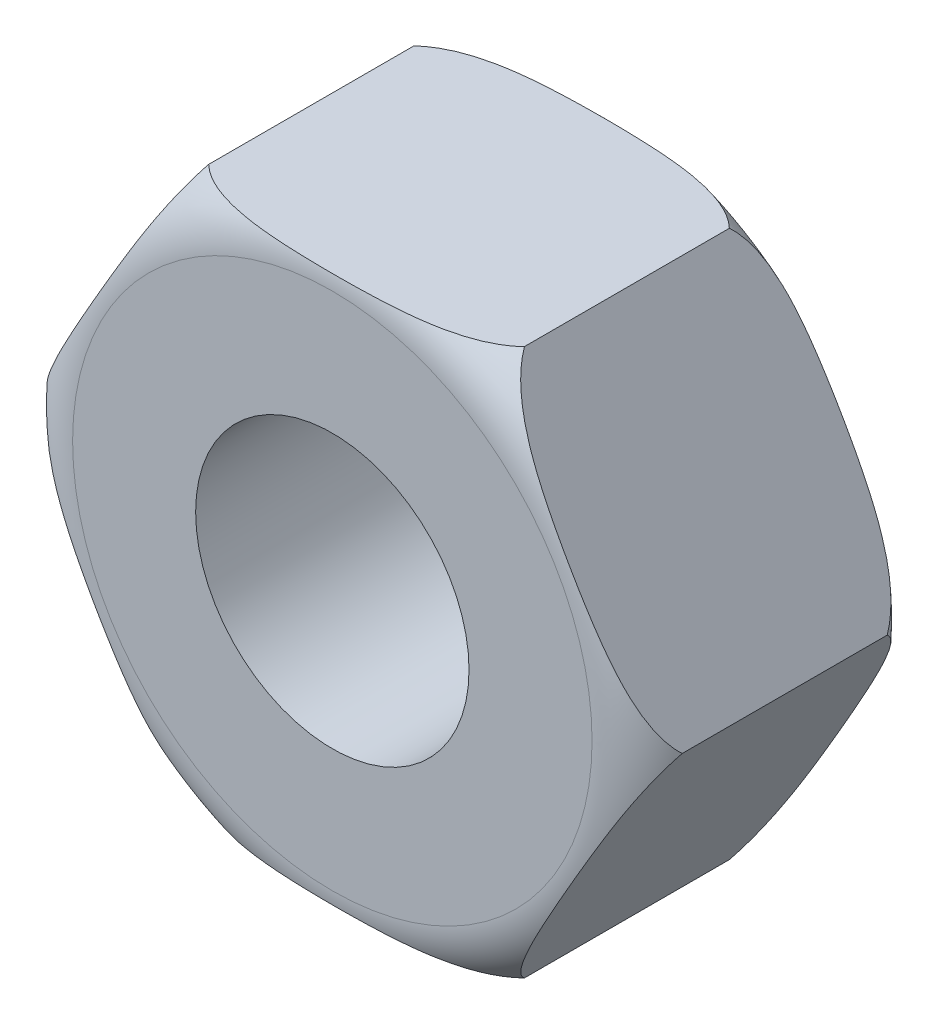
ISO-10303-21;
HEADER;
FILE_DESCRIPTION(('STEP AP214'),'2;1');
FILE_NAME('part.step','',(''),(''),'','','');
FILE_SCHEMA(('AUTOMOTIVE_DESIGN { 1 0 10303 214 1 1 1 1 }'));
ENDSEC;
DATA;
#1=APPLICATION_CONTEXT('core data for automotive mechanical design processes');
#2=APPLICATION_PROTOCOL_DEFINITION('international standard','automotive_design',2000,#1);
#3=PRODUCT_CONTEXT('',#1,'mechanical');
#4=PRODUCT('Part','Part','',(#3));
#5=PRODUCT_RELATED_PRODUCT_CATEGORY('part','',(#4));
#6=PRODUCT_DEFINITION_FORMATION('','',#4);
#7=PRODUCT_DEFINITION_CONTEXT('part definition',#1,'design');
#8=PRODUCT_DEFINITION('design','',#6,#7);
#9=PRODUCT_DEFINITION_SHAPE('','',#8);
#10=(LENGTH_UNIT() NAMED_UNIT(*) SI_UNIT(.MILLI.,.METRE.));
#11=(NAMED_UNIT(*) PLANE_ANGLE_UNIT() SI_UNIT($,.RADIAN.));
#12=(NAMED_UNIT(*) SI_UNIT($,.STERADIAN.) SOLID_ANGLE_UNIT());
#13=UNCERTAINTY_MEASURE_WITH_UNIT(LENGTH_MEASURE(1.E-05),#10,'distance_accuracy_value','');
#14=(GEOMETRIC_REPRESENTATION_CONTEXT(3) GLOBAL_UNCERTAINTY_ASSIGNED_CONTEXT((#13)) GLOBAL_UNIT_ASSIGNED_CONTEXT((#10,
#11,#12)) REPRESENTATION_CONTEXT('',''));
#15=CARTESIAN_POINT('',(0.,0.,0.));
#16=DIRECTION('',(0.,0.,1.));
#17=DIRECTION('',(1.,0.,0.));
#18=AXIS2_PLACEMENT_3D('',#15,#16,#17);
#19=CARTESIAN_POINT('',(0.,0.,5.));
#20=DIRECTION('',(0.,0.,1.));
#21=DIRECTION('',(1.,0.,0.));
#22=AXIS2_PLACEMENT_3D('',#19,#20,#21);
#23=PLANE('',#22);
#24=CARTESIAN_POINT('',(0.,0.,5.));
#25=DIRECTION('',(0.,0.,1.));
#26=DIRECTION('',(1.,0.,0.));
#27=AXIS2_PLACEMENT_3D('',#24,#25,#26);
#28=CIRCLE('',#27,4.75);
#29=CARTESIAN_POINT('',(4.75,0.,5.));
#30=VERTEX_POINT('',#29);
#31=EDGE_CURVE('E91',#30,#30,#28,.T.);
#32=ORIENTED_EDGE('',*,*,#31,.T.);
#33=EDGE_LOOP('',(#32));
#34=FACE_BOUND('',#33,.T.);
#35=CARTESIAN_POINT('',(0.,0.,5.));
#36=DIRECTION('',(0.,0.,1.));
#37=DIRECTION('',(1.,0.,0.));
#38=AXIS2_PLACEMENT_3D('',#35,#36,#37);
#39=CIRCLE('',#38,2.5);
#40=CARTESIAN_POINT('',(2.5,0.,5.));
#41=VERTEX_POINT('',#40);
#42=EDGE_CURVE('E211',#41,#41,#39,.T.);
#43=ORIENTED_EDGE('',*,*,#42,.F.);
#44=EDGE_LOOP('',(#43));
#45=FACE_BOUND('',#44,.T.);
#46=ADVANCED_FACE('F32',(#34,#45),#23,.T.);
#47=CARTESIAN_POINT('',(0.,0.,0.));
#48=DIRECTION('',(0.,0.,1.));
#49=DIRECTION('',(1.,0.,0.));
#50=AXIS2_PLACEMENT_3D('',#47,#48,#49);
#51=PLANE('',#50);
#52=CARTESIAN_POINT('',(0.,0.,0.));
#53=DIRECTION('',(0.,0.,1.));
#54=DIRECTION('',(1.,0.,0.));
#55=AXIS2_PLACEMENT_3D('',#52,#53,#54);
#56=CIRCLE('',#55,4.75);
#57=CARTESIAN_POINT('',(4.75,0.,0.));
#58=VERTEX_POINT('',#57);
#59=EDGE_CURVE('E215',#58,#58,#56,.F.);
#60=ORIENTED_EDGE('',*,*,#59,.T.);
#61=EDGE_LOOP('',(#60));
#62=FACE_BOUND('',#61,.T.);
#63=CARTESIAN_POINT('',(0.,0.,0.));
#64=DIRECTION('',(0.,0.,1.));
#65=DIRECTION('',(1.,0.,0.));
#66=AXIS2_PLACEMENT_3D('',#63,#64,#65);
#67=CIRCLE('',#66,2.5);
#68=CARTESIAN_POINT('',(2.5,0.,0.));
#69=VERTEX_POINT('',#68);
#70=EDGE_CURVE('E209',#69,#69,#67,.T.);
#71=ORIENTED_EDGE('',*,*,#70,.T.);
#72=EDGE_LOOP('',(#71));
#73=FACE_BOUND('',#72,.T.);
#74=ADVANCED_FACE('F228',(#62,#73),#51,.F.);
#75=CARTESIAN_POINT('',(0.,0.,5.));
#76=DIRECTION('',(0.,0.,-1.));
#77=DIRECTION('',(-1.,0.,0.));
#78=AXIS2_PLACEMENT_3D('',#75,#76,#77);
#79=CYLINDRICAL_SURFACE('',#78,2.5);
#80=ORIENTED_EDGE('',*,*,#42,.T.);
#81=EDGE_LOOP('',(#80));
#82=FACE_BOUND('',#81,.T.);
#83=ORIENTED_EDGE('',*,*,#70,.F.);
#84=EDGE_LOOP('',(#83));
#85=FACE_BOUND('',#84,.T.);
#86=ADVANCED_FACE('F151',(#82,#85),#79,.F.);
#87=CARTESIAN_POINT('',(0.,0.,1.15));
#88=DIRECTION('',(0.,0.,1.));
#89=DIRECTION('',(1.,0.,0.));
#90=AXIS2_PLACEMENT_3D('',#87,#88,#89);
#91=TOROIDAL_SURFACE('',#90,4.75,1.15);
#92=CARTESIAN_POINT('',(5.77361816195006,-0.000199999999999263,0.62587611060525));
#93=CARTESIAN_POINT('',(5.75568271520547,0.0308651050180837,0.590905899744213));
#94=CARTESIAN_POINT('',(5.73660325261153,0.0639117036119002,0.558486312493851));
#95=CARTESIAN_POINT('',(5.69679265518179,0.132865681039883,0.498360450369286));
#96=CARTESIAN_POINT('',(5.67606932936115,0.168759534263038,0.470633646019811));
#97=CARTESIAN_POINT('',(5.63385412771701,0.241878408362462,0.419704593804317));
#98=CARTESIAN_POINT('',(5.61238527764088,0.279063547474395,0.396424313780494));
#99=CARTESIAN_POINT('',(5.56859226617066,0.354915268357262,0.353216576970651));
#100=CARTESIAN_POINT('',(5.54626699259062,0.393583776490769,0.333293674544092));
#101=CARTESIAN_POINT('',(5.47675124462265,0.513988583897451,0.276580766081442));
#102=CARTESIAN_POINT('',(5.42857635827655,0.597429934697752,0.244621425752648));
#103=CARTESIAN_POINT('',(5.33093604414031,0.766547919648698,0.190090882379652));
#104=CARTESIAN_POINT('',(5.28146921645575,0.852226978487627,0.167530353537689));
#105=CARTESIAN_POINT('',(5.18118437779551,1.02592541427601,0.129135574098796));
#106=CARTESIAN_POINT('',(5.13035714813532,1.11396075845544,0.113400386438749));
#107=CARTESIAN_POINT('',(5.02835828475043,1.29062797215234,0.087198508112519));
#108=CARTESIAN_POINT('',(4.97718650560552,1.37926009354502,0.076734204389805));
#109=CARTESIAN_POINT('',(4.85264042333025,1.59498023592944,0.0559028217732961));
#110=CARTESIAN_POINT('',(4.77918683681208,1.72220557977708,0.0475149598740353));
#111=CARTESIAN_POINT('',(4.6321723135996,1.97684220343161,0.0354581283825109));
#112=CARTESIAN_POINT('',(4.55861134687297,2.10425353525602,0.0317909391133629));
#113=CARTESIAN_POINT('',(4.41159164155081,2.35889913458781,0.0275760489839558));
#114=CARTESIAN_POINT('',(4.33813293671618,2.4861333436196,0.0270231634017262));
#115=CARTESIAN_POINT('',(4.19125522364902,2.74053300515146,0.0287478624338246));
#116=CARTESIAN_POINT('',(4.11783621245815,2.86769846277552,0.0310241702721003));
#117=CARTESIAN_POINT('',(3.97015321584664,3.12349291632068,0.0395243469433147));
#118=CARTESIAN_POINT('',(3.89588986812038,3.25212080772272,0.0457961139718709));
#119=CARTESIAN_POINT('',(3.74741807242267,3.50928150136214,0.0648337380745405));
#120=CARTESIAN_POINT('',(3.67320989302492,3.63781383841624,0.077609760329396));
#121=CARTESIAN_POINT('',(3.56259222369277,3.82940926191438,0.104664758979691));
#122=CARTESIAN_POINT('',(3.52594292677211,3.89288770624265,0.114956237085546));
#123=CARTESIAN_POINT('',(3.45291859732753,4.0193695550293,0.138847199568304));
#124=CARTESIAN_POINT('',(3.41654349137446,4.08237308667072,0.152445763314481));
#125=CARTESIAN_POINT('',(3.34433563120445,4.20744076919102,0.183714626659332));
#126=CARTESIAN_POINT('',(3.30850161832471,4.26950710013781,0.201373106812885));
#127=CARTESIAN_POINT('',(3.23756482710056,4.39237322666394,0.24175787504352));
#128=CARTESIAN_POINT('',(3.20246146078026,4.4531740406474,0.264479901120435));
#129=CARTESIAN_POINT('',(3.14697284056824,4.54928315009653,0.306052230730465));
#130=CARTESIAN_POINT('',(3.12621692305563,4.58523345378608,0.322923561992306));
#131=CARTESIAN_POINT('',(3.08527475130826,4.65614737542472,0.359319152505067));
#132=CARTESIAN_POINT('',(3.06508880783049,4.69111045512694,0.378844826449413));
#133=CARTESIAN_POINT('',(3.02561460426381,4.75948178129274,0.420779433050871));
#134=CARTESIAN_POINT('',(3.00632207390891,4.79289742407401,0.443172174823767));
#135=CARTESIAN_POINT('',(2.96881284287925,4.85786531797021,0.491274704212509));
#136=CARTESIAN_POINT('',(2.95059489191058,4.88941973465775,0.51698052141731));
#137=CARTESIAN_POINT('',(2.91693693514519,4.94771702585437,0.570019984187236));
#138=CARTESIAN_POINT('',(2.9013910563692,4.97464327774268,0.597086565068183));
#139=CARTESIAN_POINT('',(2.88663587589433,5.0002,0.62587611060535));
#140=B_SPLINE_CURVE_WITH_KNOTS('',3,(#92,#93,#94,#95,#96,#97,#98,#99,#100,#101,#102,#103,#104,
#105,#106,#107,#108,#109,#110,#111,#112,#113,#114,#115,#116,#117,#118,#119,#120,#121,#122,#123,
#124,#125,#126,#127,#128,#129,#130,#131,#132,#133,#134,#135,#136,#137,#138,#139),.UNSPECIFIED.,
.F.,.F.,(4,2,2,2,2,2,2,2,2,2,2,2,2,2,2,2,2,2,2,2,2,2,2,4),(0.,0.1499676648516,0.299261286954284,
0.445628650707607,0.592192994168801,0.895971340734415,1.20009375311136,1.50849343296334,
1.81703264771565,2.25833054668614,2.69979482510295,3.1405239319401,3.5810542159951,
4.02696765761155,4.47358014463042,4.69557567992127,4.91750948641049,5.1388051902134,
5.35991532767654,5.49426898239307,5.62869452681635,5.76239191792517,5.89593054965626,
6.01944447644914),.UNSPECIFIED.);
#141=CARTESIAN_POINT('',(5.77350269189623,0.,0.625650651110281));
#142=VERTEX_POINT('',#141);
#143=CARTESIAN_POINT('',(2.88675134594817,5.,0.625650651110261));
#144=VERTEX_POINT('',#143);
#145=EDGE_CURVE('E168',#142,#144,#140,.T.);
#146=ORIENTED_EDGE('',*,*,#145,.F.);
#147=CARTESIAN_POINT('',(2.88663587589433,-5.00019999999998,0.625876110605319));
#148=CARTESIAN_POINT('',(2.90457132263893,-4.9691348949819,0.590905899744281));
#149=CARTESIAN_POINT('',(2.92365078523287,-4.93608829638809,0.558486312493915));
#150=CARTESIAN_POINT('',(2.9634613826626,-4.86713431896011,0.498360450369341));
#151=CARTESIAN_POINT('',(2.98418470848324,-4.83124046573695,0.470633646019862));
#152=CARTESIAN_POINT('',(3.02639991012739,-4.75812159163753,0.419704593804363));
#153=CARTESIAN_POINT('',(3.04786876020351,-4.7209364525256,0.396424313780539));
#154=CARTESIAN_POINT('',(3.09166177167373,-4.64508473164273,0.353216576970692));
#155=CARTESIAN_POINT('',(3.11398704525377,-4.60641622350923,0.333293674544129));
#156=CARTESIAN_POINT('',(3.18350279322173,-4.48601141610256,0.276580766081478));
#157=CARTESIAN_POINT('',(3.23167767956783,-4.40257006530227,0.244621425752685));
#158=CARTESIAN_POINT('',(3.32931799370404,-4.23345208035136,0.19009088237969));
#159=CARTESIAN_POINT('',(3.3787848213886,-4.14777302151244,0.167530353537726));
#160=CARTESIAN_POINT('',(3.47906966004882,-3.97407458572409,0.12913557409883));
#161=CARTESIAN_POINT('',(3.52989688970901,-3.88603924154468,0.113400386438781));
#162=CARTESIAN_POINT('',(3.63189575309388,-3.7093720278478,0.0871985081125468));
#163=CARTESIAN_POINT('',(3.68306753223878,-3.62073990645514,0.0767342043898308));
#164=CARTESIAN_POINT('',(3.80761361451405,-3.40501976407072,0.0559028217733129));
#165=CARTESIAN_POINT('',(3.88106720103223,-3.27779442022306,0.0475149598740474));
#166=CARTESIAN_POINT('',(4.02808172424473,-3.02315779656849,0.0354581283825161));
#167=CARTESIAN_POINT('',(4.10164269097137,-2.89574646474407,0.0317909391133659));
#168=CARTESIAN_POINT('',(4.24866239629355,-2.64110086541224,0.0275760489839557));
#169=CARTESIAN_POINT('',(4.32212110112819,-2.51386665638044,0.0270231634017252));
#170=CARTESIAN_POINT('',(4.46899881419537,-2.25946699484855,0.0287478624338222));
#171=CARTESIAN_POINT('',(4.54241782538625,-2.13230153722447,0.0310241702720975));
#172=CARTESIAN_POINT('',(4.69010082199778,-1.87650708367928,0.0395243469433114));
#173=CARTESIAN_POINT('',(4.76436416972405,-1.74787919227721,0.0457961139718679));
#174=CARTESIAN_POINT('',(4.91283596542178,-1.49071849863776,0.0648337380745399));
#175=CARTESIAN_POINT('',(4.98704414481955,-1.36218616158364,0.0776097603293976));
#176=CARTESIAN_POINT('',(5.09766181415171,-1.17059073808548,0.104664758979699));
#177=CARTESIAN_POINT('',(5.13431111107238,-1.1071122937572,0.114956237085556));
#178=CARTESIAN_POINT('',(5.20733544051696,-0.980630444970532,0.138847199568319));
#179=CARTESIAN_POINT('',(5.24371054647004,-0.917626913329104,0.152445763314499));
#180=CARTESIAN_POINT('',(5.31591840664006,-0.792559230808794,0.183714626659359));
#181=CARTESIAN_POINT('',(5.35175241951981,-0.730492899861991,0.201373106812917));
#182=CARTESIAN_POINT('',(5.42268921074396,-0.607626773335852,0.241757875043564));
#183=CARTESIAN_POINT('',(5.45779257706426,-0.546825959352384,0.264479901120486));
#184=CARTESIAN_POINT('',(5.51328119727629,-0.450716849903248,0.306052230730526));
#185=CARTESIAN_POINT('',(5.5340371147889,-0.414766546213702,0.322923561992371));
#186=CARTESIAN_POINT('',(5.57497928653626,-0.343852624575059,0.359319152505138));
#187=CARTESIAN_POINT('',(5.59516523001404,-0.30888954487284,0.378844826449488));
#188=CARTESIAN_POINT('',(5.63463943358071,-0.240518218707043,0.420779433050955));
#189=CARTESIAN_POINT('',(5.65393196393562,-0.207102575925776,0.443172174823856));
#190=CARTESIAN_POINT('',(5.69144119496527,-0.142134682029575,0.491274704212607));
#191=CARTESIAN_POINT('',(5.70965914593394,-0.110580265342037,0.516980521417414));
#192=CARTESIAN_POINT('',(5.74331710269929,-0.0522829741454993,0.570019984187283));
#193=CARTESIAN_POINT('',(5.75886298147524,-0.0253567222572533,0.597086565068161));
#194=CARTESIAN_POINT('',(5.77361816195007,0.00019999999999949,0.625876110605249));
#195=B_SPLINE_CURVE_WITH_KNOTS('',3,(#147,#148,#149,#150,#151,#152,#153,#154,#155,#156,#157,
#158,#159,#160,#161,#162,#163,#164,#165,#166,#167,#168,#169,#170,#171,#172,#173,#174,#175,#176,
#177,#178,#179,#180,#181,#182,#183,#184,#185,#186,#187,#188,#189,#190,#191,#192,#193,#194),
.UNSPECIFIED.,.F.,.F.,(4,2,2,2,2,2,2,2,2,2,2,2,2,2,2,2,2,2,2,2,2,2,2,4),(0.,0.149967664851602,
0.299261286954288,0.445628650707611,0.592192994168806,0.895971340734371,1.20009375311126,
1.5084934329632,1.81703264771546,2.25833054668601,2.69979482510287,3.14052393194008,
3.58105421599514,4.02696765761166,4.47358014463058,4.69557567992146,4.91750948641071,
5.13880519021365,5.35991532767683,5.49426898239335,5.62869452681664,5.76239191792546,
5.89593054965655,6.01944447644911),.UNSPECIFIED.);
#196=CARTESIAN_POINT('',(2.8867513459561,-4.99999999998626,0.625650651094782));
#197=VERTEX_POINT('',#196);
#198=EDGE_CURVE('E138',#197,#142,#195,.T.);
#199=ORIENTED_EDGE('',*,*,#198,.F.);
#200=CARTESIAN_POINT('',(0.,-5.,0.0275027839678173));
#201=CARTESIAN_POINT('',(0.0971429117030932,-5.,0.0275012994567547));
#202=CARTESIAN_POINT('',(0.194286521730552,-5.,0.028122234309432));
#203=CARTESIAN_POINT('',(0.388561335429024,-5.,0.0307305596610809));
#204=CARTESIAN_POINT('',(0.485692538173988,-5.,0.0327180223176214));
#205=CARTESIAN_POINT('',(0.680143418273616,-5.,0.0384519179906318));
#206=CARTESIAN_POINT('',(0.777462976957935,-5.,0.0422026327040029));
#207=CARTESIAN_POINT('',(0.971975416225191,-4.99999999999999,0.0521090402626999));
#208=CARTESIAN_POINT('',(1.06916830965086,-4.99999999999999,0.0582644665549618));
#209=CARTESIAN_POINT('',(1.26259671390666,-4.99999999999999,0.0738381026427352));
#210=CARTESIAN_POINT('',(1.35883406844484,-4.99999999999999,0.0832324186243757));
#211=CARTESIAN_POINT('',(1.55084316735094,-4.99999999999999,0.10648268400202));
#212=CARTESIAN_POINT('',(1.64661464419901,-4.99999999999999,0.120340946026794));
#213=CARTESIAN_POINT('',(1.83664500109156,-4.99999999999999,0.15396319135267));
#214=CARTESIAN_POINT('',(1.93090907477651,-4.99999999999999,0.173697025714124));
#215=CARTESIAN_POINT('',(2.11740788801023,-4.99999999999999,0.221018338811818));
#216=CARTESIAN_POINT('',(2.20964537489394,-4.99999999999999,0.24859437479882));
#217=CARTESIAN_POINT('',(2.34586844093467,-4.99999999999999,0.297994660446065));
#218=CARTESIAN_POINT('',(2.39125165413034,-4.99999999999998,0.315966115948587));
#219=CARTESIAN_POINT('',(2.48071637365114,-4.99999999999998,0.355018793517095));
#220=CARTESIAN_POINT('',(2.52479691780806,-4.99999999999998,0.376102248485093));
#221=CARTESIAN_POINT('',(2.61086584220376,-4.99999999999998,0.421698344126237));
#222=CARTESIAN_POINT('',(2.65286415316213,-4.99999999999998,0.446192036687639));
#223=CARTESIAN_POINT('',(2.73424457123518,-4.99999999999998,0.499152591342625));
#224=CARTESIAN_POINT('',(2.77362966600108,-4.99999999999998,0.527614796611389));
#225=CARTESIAN_POINT('',(2.84686361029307,-4.99999999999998,0.587431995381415));
#226=CARTESIAN_POINT('',(2.8808929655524,-4.99999999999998,0.618563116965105));
#227=CARTESIAN_POINT('',(2.94450942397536,-4.99999999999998,0.685196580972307));
#228=CARTESIAN_POINT('',(2.97409256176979,-4.99999999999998,0.720702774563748));
#229=CARTESIAN_POINT('',(3.02747416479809,-4.99999999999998,0.796554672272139));
#230=CARTESIAN_POINT('',(3.05119881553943,-4.99999999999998,0.836953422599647));
#231=CARTESIAN_POINT('',(3.09034956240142,-4.99999999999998,0.921588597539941));
#232=CARTESIAN_POINT('',(3.10579372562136,-4.99999999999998,0.965816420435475));
#233=CARTESIAN_POINT('',(3.12541131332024,-4.99999999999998,1.05115432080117));
#234=CARTESIAN_POINT('',(3.13071429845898,-4.99999999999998,1.09200217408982));
#235=CARTESIAN_POINT('',(3.13299430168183,-4.99999999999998,1.17393041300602));
#236=CARTESIAN_POINT('',(3.12997471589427,-4.99999999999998,1.21501069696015));
#237=CARTESIAN_POINT('',(3.11704055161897,-4.99999999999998,1.28953277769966));
#238=CARTESIAN_POINT('',(3.10825524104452,-4.99999999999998,1.32317930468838));
#239=CARTESIAN_POINT('',(3.08560940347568,-4.99999999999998,1.38869550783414));
#240=CARTESIAN_POINT('',(3.07174835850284,-4.99999999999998,1.42056500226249));
#241=CARTESIAN_POINT('',(3.03357193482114,-4.99999999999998,1.49388962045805));
#242=CARTESIAN_POINT('',(3.00728611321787,-4.99999999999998,1.53431679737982));
#243=CARTESIAN_POINT('',(2.94856101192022,-4.99999999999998,1.61044008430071));
#244=CARTESIAN_POINT('',(2.91610612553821,-4.99999999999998,1.64612379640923));
#245=CARTESIAN_POINT('',(2.82854261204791,-4.99999999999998,1.7304228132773));
#246=CARTESIAN_POINT('',(2.77049815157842,-4.99999999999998,1.77596613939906));
#247=CARTESIAN_POINT('',(2.64835812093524,-4.99999999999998,1.85773624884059));
#248=CARTESIAN_POINT('',(2.58425712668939,-4.99999999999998,1.89395457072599));
#249=CARTESIAN_POINT('',(2.45668978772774,-4.99999999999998,1.95665480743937));
#250=CARTESIAN_POINT('',(2.39345480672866,-4.99999999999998,1.98361773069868));
#251=CARTESIAN_POINT('',(2.26489469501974,-4.99999999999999,2.03208710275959));
#252=CARTESIAN_POINT('',(2.19956753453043,-4.99999999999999,2.05358806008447));
#253=CARTESIAN_POINT('',(2.06723295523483,-4.99999999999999,2.0922070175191));
#254=CARTESIAN_POINT('',(2.0002178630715,-4.99999999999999,2.10929823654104));
#255=CARTESIAN_POINT('',(1.86541787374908,-4.99999999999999,2.13974853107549));
#256=CARTESIAN_POINT('',(1.79763364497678,-4.99999999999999,2.15311062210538));
#257=CARTESIAN_POINT('',(1.65622010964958,-4.99999999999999,2.17773921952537));
#258=CARTESIAN_POINT('',(1.58254867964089,-4.99999999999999,2.18875974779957));
#259=CARTESIAN_POINT('',(1.43483513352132,-4.99999999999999,2.20799478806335));
#260=CARTESIAN_POINT('',(1.3607929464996,-4.99999999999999,2.2162087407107));
#261=CARTESIAN_POINT('',(1.13822877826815,-4.99999999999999,2.23756000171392));
#262=CARTESIAN_POINT('',(0.989395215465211,-4.99999999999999,2.24738702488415));
#263=CARTESIAN_POINT('',(0.690760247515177,-5.,2.26172823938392));
#264=CARTESIAN_POINT('',(0.54095778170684,-5.,2.26621503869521));
#265=CARTESIAN_POINT('',(0.241380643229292,-5.,2.27175510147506));
#266=CARTESIAN_POINT('',(0.0916060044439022,-5.,2.2728103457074));
#267=CARTESIAN_POINT('',(-0.208158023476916,-5.,2.27203271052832));
#268=CARTESIAN_POINT('',(-0.358147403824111,-5.,2.2701955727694));
#269=CARTESIAN_POINT('',(-0.658139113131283,-5.00000000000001,2.26270333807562));
#270=CARTESIAN_POINT('',(-0.808141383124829,-5.00000000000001,2.25704567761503));
#271=CARTESIAN_POINT('',(-1.10700621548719,-5.00000000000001,2.2395956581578));
#272=CARTESIAN_POINT('',(-1.25587043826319,-5.00000000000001,2.22783803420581));
#273=CARTESIAN_POINT('',(-1.47825332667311,-5.00000000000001,2.20269501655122));
#274=CARTESIAN_POINT('',(-1.55218945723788,-5.00000000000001,2.19307005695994));
#275=CARTESIAN_POINT('',(-1.69957232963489,-5.00000000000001,2.17064798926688));
#276=CARTESIAN_POINT('',(-1.77301918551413,-5.00000000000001,2.15785164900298));
#277=CARTESIAN_POINT('',(-1.91954007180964,-5.00000000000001,2.12821632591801));
#278=CARTESIAN_POINT('',(-1.99260967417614,-5.00000000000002,2.1113549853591));
#279=CARTESIAN_POINT('',(-2.13753701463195,-5.00000000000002,2.07261495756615));
#280=CARTESIAN_POINT('',(-2.20939309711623,-5.00000000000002,2.0507299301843));
#281=CARTESIAN_POINT('',(-2.35017382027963,-5.00000000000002,2.00101354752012));
#282=CARTESIAN_POINT('',(-2.41912198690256,-5.00000000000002,1.97325012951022));
#283=CARTESIAN_POINT('',(-2.55344781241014,-5.00000000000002,1.91024078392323));
#284=CARTESIAN_POINT('',(-2.61883261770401,-5.00000000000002,1.87501058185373));
#285=CARTESIAN_POINT('',(-2.73384073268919,-5.00000000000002,1.80174764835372));
#286=CARTESIAN_POINT('',(-2.78431194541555,-5.00000000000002,1.76506544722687));
#287=CARTESIAN_POINT('',(-2.87897666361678,-5.00000000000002,1.68417855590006));
#288=CARTESIAN_POINT('',(-2.92317666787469,-5.00000000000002,1.63998175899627));
#289=CARTESIAN_POINT('',(-2.98859836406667,-5.00000000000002,1.55983279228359));
#290=CARTESIAN_POINT('',(-3.0125455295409,-5.00000000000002,1.5261167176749));
#291=CARTESIAN_POINT('',(-3.05487022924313,-5.00000000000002,1.45532994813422));
#292=CARTESIAN_POINT('',(-3.07325285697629,-5.00000000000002,1.41826236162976));
#293=CARTESIAN_POINT('',(-3.10324323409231,-5.00000000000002,1.34098201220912));
#294=CARTESIAN_POINT('',(-3.11477863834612,-5.00000000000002,1.30074058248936));
#295=CARTESIAN_POINT('',(-3.1296066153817,-5.00000000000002,1.21876473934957));
#296=CARTESIAN_POINT('',(-3.13290746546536,-5.00000000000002,1.17703186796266));
#297=CARTESIAN_POINT('',(-3.13106894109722,-5.00000000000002,1.09972543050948));
#298=CARTESIAN_POINT('',(-3.1270630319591,-5.00000000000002,1.06411989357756));
#299=CARTESIAN_POINT('',(-3.11308423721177,-5.00000000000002,0.994108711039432));
#300=CARTESIAN_POINT('',(-3.10311025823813,-5.00000000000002,0.959703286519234));
#301=CARTESIAN_POINT('',(-3.0779689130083,-5.00000000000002,0.893037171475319));
#302=CARTESIAN_POINT('',(-3.0628227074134,-5.00000000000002,0.860768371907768));
#303=CARTESIAN_POINT('',(-3.02820652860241,-5.00000000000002,0.798663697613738));
#304=CARTESIAN_POINT('',(-3.00873471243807,-5.00000000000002,0.768828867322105));
#305=CARTESIAN_POINT('',(-2.95301645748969,-5.00000000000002,0.693875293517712));
#306=CARTESIAN_POINT('',(-2.91390247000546,-5.00000000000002,0.650888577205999));
#307=CARTESIAN_POINT('',(-2.82944308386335,-5.00000000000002,0.57154319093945));
#308=CARTESIAN_POINT('',(-2.78408104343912,-5.00000000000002,0.535202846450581));
#309=CARTESIAN_POINT('',(-2.6971090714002,-5.00000000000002,0.47400854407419));
#310=CARTESIAN_POINT('',(-2.65612337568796,-5.00000000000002,0.448249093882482));
#311=CARTESIAN_POINT('',(-2.57205923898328,-5.00000000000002,0.400366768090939));
#312=CARTESIAN_POINT('',(-2.52897926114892,-5.00000000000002,0.378246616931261));
#313=CARTESIAN_POINT('',(-2.44124730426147,-5.00000000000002,0.337164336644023));
#314=CARTESIAN_POINT('',(-2.39659226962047,-5.00000000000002,0.318208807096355));
#315=CARTESIAN_POINT('',(-2.30622229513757,-5.00000000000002,0.283103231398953));
#316=CARTESIAN_POINT('',(-2.26050772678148,-5.00000000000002,0.266952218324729));
#317=CARTESIAN_POINT('',(-2.14797084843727,-5.00000000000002,0.230491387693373));
#318=CARTESIAN_POINT('',(-2.0807268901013,-5.00000000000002,0.211486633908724));
#319=CARTESIAN_POINT('',(-1.9451988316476,-5.00000000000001,0.17758734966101));
#320=CARTESIAN_POINT('',(-1.87691417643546,-5.00000000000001,0.162695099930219));
#321=CARTESIAN_POINT('',(-1.67085461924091,-5.00000000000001,0.122965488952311));
#322=CARTESIAN_POINT('',(-1.5321205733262,-5.00000000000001,0.103148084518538));
#323=CARTESIAN_POINT('',(-1.25340738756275,-5.00000000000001,0.0721524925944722));
#324=CARTESIAN_POINT('',(-1.11342579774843,-5.00000000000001,0.060999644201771));
#325=CARTESIAN_POINT('',(-0.833291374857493,-5.00000000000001,0.0442255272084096));
#326=CARTESIAN_POINT('',(-0.693138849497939,-5.00000000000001,0.0385987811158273));
#327=CARTESIAN_POINT('',(-0.460851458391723,-5.,0.0321865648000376));
#328=CARTESIAN_POINT('',(-0.368738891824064,-5.,0.0304024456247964));
#329=CARTESIAN_POINT('',(-0.230512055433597,-5.,0.028647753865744));
#330=CARTESIAN_POINT('',(-0.184403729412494,-5.,0.0282164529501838));
#331=CARTESIAN_POINT('',(-0.0921969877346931,-5.,0.0276443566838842));
#332=CARTESIAN_POINT('',(-0.0460985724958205,-5.,0.0275034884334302));
#333=CARTESIAN_POINT('',(0.,-5.,0.0275027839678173));
#334=B_SPLINE_CURVE_WITH_KNOTS('',3,(#200,#201,#202,#203,#204,#205,#206,#207,#208,#209,#210,
#211,#212,#213,#214,#215,#216,#217,#218,#219,#220,#221,#222,#223,#224,#225,#226,#227,#228,#229,
#230,#231,#232,#233,#234,#235,#236,#237,#238,#239,#240,#241,#242,#243,#244,#245,#246,#247,#248,
#249,#250,#251,#252,#253,#254,#255,#256,#257,#258,#259,#260,#261,#262,#263,#264,#265,#266,#267,
#268,#269,#270,#271,#272,#273,#274,#275,#276,#277,#278,#279,#280,#281,#282,#283,#284,#285,#286,
#287,#288,#289,#290,#291,#292,#293,#294,#295,#296,#297,#298,#299,#300,#301,#302,#303,#304,#305,
#306,#307,#308,#309,#310,#311,#312,#313,#314,#315,#316,#317,#318,#319,#320,#321,#322,#323,#324,
#325,#326,#327,#328,#329,#330,#331,#332,#333),.UNSPECIFIED.,.T.,.F.,(4,2,2,2,2,2,2,2,2,2,2,2,2,
2,2,2,2,2,2,2,2,2,2,2,2,2,2,2,2,2,2,2,2,2,2,2,2,2,2,2,2,2,2,2,2,2,2,2,2,2,2,2,2,2,2,2,2,2,2,2,2,
2,2,2,2,2,4),(0.,0.291427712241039,0.582870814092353,0.875025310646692,1.16714743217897,
1.45715906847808,1.74732119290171,2.03601936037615,2.32429842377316,2.47064302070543,
2.61709313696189,2.76275980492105,2.90825695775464,3.04627589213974,3.18441719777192,
3.3242191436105,3.46371480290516,3.5864807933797,3.7091966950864,3.8130798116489,
3.91697353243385,4.06082849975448,4.20505235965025,4.42514482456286,4.64543630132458,
4.85135773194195,5.05748538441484,5.26483688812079,5.47202023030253,5.69542465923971,
5.9188735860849,6.36615337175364,6.81571767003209,7.26502242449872,7.71498929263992,
8.16525838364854,8.6129911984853,8.83661878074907,9.06019227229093,9.28502466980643,
9.51014239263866,9.73278803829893,9.95496935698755,10.1415979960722,10.3280317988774,
10.451679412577,10.5752135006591,10.7000305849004,10.8247221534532,10.9316823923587,
11.0386622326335,11.1452095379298,11.2518023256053,11.425161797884,11.5989922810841,
11.7440116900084,11.8891391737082,12.034565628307,12.1799418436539,12.3894005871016,
12.5989752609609,13.0188917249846,13.4400316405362,13.8607536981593,14.1371370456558,
14.2754670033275,14.4137622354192),.UNSPECIFIED.);
#335=CARTESIAN_POINT('',(-2.8867513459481,-5.00000000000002,0.625650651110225));
#336=VERTEX_POINT('',#335);
#337=EDGE_CURVE('E98',#336,#197,#334,.T.);
#338=ORIENTED_EDGE('',*,*,#337,.F.);
#339=CARTESIAN_POINT('',(-5.7736181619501,0.000199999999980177,0.625876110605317));
#340=CARTESIAN_POINT('',(-5.75568271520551,-0.0308651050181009,0.590905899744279));
#341=CARTESIAN_POINT('',(-5.73660325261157,-0.0639117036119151,0.558486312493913));
#342=CARTESIAN_POINT('',(-5.69679265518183,-0.132865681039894,0.49836045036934));
#343=CARTESIAN_POINT('',(-5.67606932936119,-0.168759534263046,0.470633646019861));
#344=CARTESIAN_POINT('',(-5.63385412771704,-0.241878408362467,0.419704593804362));
#345=CARTESIAN_POINT('',(-5.61238527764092,-0.2790635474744,0.396424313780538));
#346=CARTESIAN_POINT('',(-5.5685922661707,-0.354915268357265,0.35321657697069));
#347=CARTESIAN_POINT('',(-5.54626699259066,-0.393583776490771,0.333293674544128));
#348=CARTESIAN_POINT('',(-5.47675124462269,-0.513988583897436,0.276580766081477));
#349=CARTESIAN_POINT('',(-5.4285763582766,-0.597429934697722,0.244621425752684));
#350=CARTESIAN_POINT('',(-5.33093604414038,-0.766547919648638,0.190090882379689));
#351=CARTESIAN_POINT('',(-5.28146921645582,-0.852226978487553,0.167530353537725));
#352=CARTESIAN_POINT('',(-5.18118437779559,-1.02592541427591,0.129135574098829));
#353=CARTESIAN_POINT('',(-5.13035714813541,-1.11396075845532,0.11340038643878));
#354=CARTESIAN_POINT('',(-5.02835828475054,-1.2906279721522,0.0871985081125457));
#355=CARTESIAN_POINT('',(-4.97718650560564,-1.37926009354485,0.0767342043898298));
#356=CARTESIAN_POINT('',(-4.85264042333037,-1.59498023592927,0.0559028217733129));
#357=CARTESIAN_POINT('',(-4.77918683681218,-1.72220557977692,0.0475149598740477));
#358=CARTESIAN_POINT('',(-4.63217231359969,-1.97684220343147,0.0354581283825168));
#359=CARTESIAN_POINT('',(-4.55861134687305,-2.10425353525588,0.0317909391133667));
#360=CARTESIAN_POINT('',(-4.41159164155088,-2.35889913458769,0.027576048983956));
#361=CARTESIAN_POINT('',(-4.33813293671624,-2.48613334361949,0.027023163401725));
#362=CARTESIAN_POINT('',(-4.19125522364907,-2.74053300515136,0.0287478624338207));
#363=CARTESIAN_POINT('',(-4.11783621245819,-2.86769846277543,0.0310241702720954));
#364=CARTESIAN_POINT('',(-3.97015321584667,-3.1234929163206,0.0395243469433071));
#365=CARTESIAN_POINT('',(-3.8958898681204,-3.25212080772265,0.0457961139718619));
#366=CARTESIAN_POINT('',(-3.74741807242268,-3.50928150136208,0.0648337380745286));
#367=CARTESIAN_POINT('',(-3.67320989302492,-3.63781383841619,0.0776097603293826));
#368=CARTESIAN_POINT('',(-3.56259222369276,-3.82940926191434,0.104664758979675));
#369=CARTESIAN_POINT('',(-3.52594292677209,-3.89288770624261,0.114956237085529));
#370=CARTESIAN_POINT('',(-3.45291859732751,-4.01936955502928,0.138847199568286));
#371=CARTESIAN_POINT('',(-3.41654349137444,-4.0823730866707,0.152445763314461));
#372=CARTESIAN_POINT('',(-3.34433563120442,-4.207440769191,0.183714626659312));
#373=CARTESIAN_POINT('',(-3.30850161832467,-4.2695071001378,0.201373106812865));
#374=CARTESIAN_POINT('',(-3.23756482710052,-4.39237322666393,0.241757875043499));
#375=CARTESIAN_POINT('',(-3.20246146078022,-4.4531740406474,0.264479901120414));
#376=CARTESIAN_POINT('',(-3.14697284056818,-4.54928315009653,0.306052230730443));
#377=CARTESIAN_POINT('',(-3.12621692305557,-4.58523345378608,0.322923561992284));
#378=CARTESIAN_POINT('',(-3.08527475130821,-4.65614737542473,0.359319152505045));
#379=CARTESIAN_POINT('',(-3.06508880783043,-4.69111045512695,0.378844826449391));
#380=CARTESIAN_POINT('',(-3.02561460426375,-4.75948178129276,0.42077943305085));
#381=CARTESIAN_POINT('',(-3.00632207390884,-4.79289742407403,0.443172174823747));
#382=CARTESIAN_POINT('',(-2.96881284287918,-4.85786531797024,0.49127470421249));
#383=CARTESIAN_POINT('',(-2.9505948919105,-4.88941973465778,0.516980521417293));
#384=CARTESIAN_POINT('',(-2.91693693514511,-4.9477170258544,0.570019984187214));
#385=CARTESIAN_POINT('',(-2.90139105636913,-4.97464327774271,0.597086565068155));
#386=CARTESIAN_POINT('',(-2.88663587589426,-5.00020000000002,0.625876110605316));
#387=B_SPLINE_CURVE_WITH_KNOTS('',3,(#339,#340,#341,#342,#343,#344,#345,#346,#347,#348,#349,
#350,#351,#352,#353,#354,#355,#356,#357,#358,#359,#360,#361,#362,#363,#364,#365,#366,#367,#368,
#369,#370,#371,#372,#373,#374,#375,#376,#377,#378,#379,#380,#381,#382,#383,#384,#385,#386),
.UNSPECIFIED.,.F.,.F.,(4,2,2,2,2,2,2,2,2,2,2,2,2,2,2,2,2,2,2,2,2,2,2,4),(0.,0.149967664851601,
0.299261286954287,0.44562865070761,0.592192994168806,0.895971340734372,1.20009375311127,
1.5084934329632,1.81703264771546,2.25833054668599,2.69979482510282,3.14052393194,
3.58105421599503,4.02696765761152,4.47358014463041,4.69557567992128,4.91750948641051,
5.13880519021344,5.3599153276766,5.49426898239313,5.62869452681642,5.76239191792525,
5.89593054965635,6.0194444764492),.UNSPECIFIED.);
#388=CARTESIAN_POINT('',(-5.77350269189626,0.,0.625650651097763));
#389=VERTEX_POINT('',#388);
#390=EDGE_CURVE('E137',#389,#336,#387,.T.);
#391=ORIENTED_EDGE('',*,*,#390,.F.);
#392=CARTESIAN_POINT('',(-2.8866358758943,5.0002,0.625876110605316));
#393=CARTESIAN_POINT('',(-2.90457132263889,4.96913489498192,0.590905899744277));
#394=CARTESIAN_POINT('',(-2.92365078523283,4.9360882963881,0.558486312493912));
#395=CARTESIAN_POINT('',(-2.96346138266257,4.86713431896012,0.498360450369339));
#396=CARTESIAN_POINT('',(-2.98418470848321,4.83124046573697,0.470633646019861));
#397=CARTESIAN_POINT('',(-3.02639991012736,4.75812159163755,0.419704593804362));
#398=CARTESIAN_POINT('',(-3.04786876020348,4.72093645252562,0.396424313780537));
#399=CARTESIAN_POINT('',(-3.0916617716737,4.64508473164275,0.35321657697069));
#400=CARTESIAN_POINT('',(-3.11398704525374,4.60641622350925,0.333293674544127));
#401=CARTESIAN_POINT('',(-3.18350279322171,4.48601141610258,0.276580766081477));
#402=CARTESIAN_POINT('',(-3.2316776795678,4.40257006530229,0.244621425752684));
#403=CARTESIAN_POINT('',(-3.32931799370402,4.23345208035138,0.190090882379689));
#404=CARTESIAN_POINT('',(-3.37878482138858,4.14777302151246,0.167530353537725));
#405=CARTESIAN_POINT('',(-3.4790696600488,3.9740745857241,0.129135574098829));
#406=CARTESIAN_POINT('',(-3.52989688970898,3.8860392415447,0.11340038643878));
#407=CARTESIAN_POINT('',(-3.63189575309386,3.70937202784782,0.0871985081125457));
#408=CARTESIAN_POINT('',(-3.68306753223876,3.62073990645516,0.0767342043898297));
#409=CARTESIAN_POINT('',(-3.80761361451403,3.40501976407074,0.055902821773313));
#410=CARTESIAN_POINT('',(-3.88106720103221,3.27779442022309,0.0475149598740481));
#411=CARTESIAN_POINT('',(-4.0280817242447,3.02315779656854,0.0354581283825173));
#412=CARTESIAN_POINT('',(-4.10164269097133,2.89574646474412,0.0317909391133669));
#413=CARTESIAN_POINT('',(-4.24866239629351,2.64110086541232,0.0275760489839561));
#414=CARTESIAN_POINT('',(-4.32212110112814,2.51386665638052,0.0270231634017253));
#415=CARTESIAN_POINT('',(-4.46899881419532,2.25946699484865,0.0287478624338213));
#416=CARTESIAN_POINT('',(-4.5424178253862,2.13230153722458,0.031024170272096));
#417=CARTESIAN_POINT('',(-4.69010082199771,1.8765070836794,0.0395243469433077));
#418=CARTESIAN_POINT('',(-4.76436416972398,1.74787919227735,0.0457961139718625));
#419=CARTESIAN_POINT('',(-4.9128359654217,1.49071849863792,0.0648337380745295));
#420=CARTESIAN_POINT('',(-4.98704414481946,1.3621861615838,0.0776097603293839));
#421=CARTESIAN_POINT('',(-5.09766181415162,1.17059073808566,0.104664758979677));
#422=CARTESIAN_POINT('',(-5.13431111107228,1.10711229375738,0.114956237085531));
#423=CARTESIAN_POINT('',(-5.20733544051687,0.980630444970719,0.138847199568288));
#424=CARTESIAN_POINT('',(-5.24371054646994,0.917626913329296,0.152445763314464));
#425=CARTESIAN_POINT('',(-5.31591840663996,0.792559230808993,0.183714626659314));
#426=CARTESIAN_POINT('',(-5.35175241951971,0.730492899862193,0.201373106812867));
#427=CARTESIAN_POINT('',(-5.42268921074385,0.60762677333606,0.241757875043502));
#428=CARTESIAN_POINT('',(-5.45779257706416,0.546825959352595,0.264479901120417));
#429=CARTESIAN_POINT('',(-5.51328119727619,0.450716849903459,0.306052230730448));
#430=CARTESIAN_POINT('',(-5.5340371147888,0.41476654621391,0.322923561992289));
#431=CARTESIAN_POINT('',(-5.57497928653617,0.343852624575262,0.35931915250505));
#432=CARTESIAN_POINT('',(-5.59516523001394,0.308889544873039,0.378844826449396));
#433=CARTESIAN_POINT('',(-5.63463943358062,0.240518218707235,0.420779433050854));
#434=CARTESIAN_POINT('',(-5.65393196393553,0.207102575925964,0.443172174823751));
#435=CARTESIAN_POINT('',(-5.69144119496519,0.142134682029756,0.491274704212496));
#436=CARTESIAN_POINT('',(-5.70965914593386,0.110580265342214,0.516980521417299));
#437=CARTESIAN_POINT('',(-5.74331710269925,0.0522829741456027,0.57001998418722));
#438=CARTESIAN_POINT('',(-5.75886298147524,0.0253567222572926,0.597086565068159));
#439=CARTESIAN_POINT('',(-5.7736181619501,-0.000200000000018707,0.625876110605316));
#440=B_SPLINE_CURVE_WITH_KNOTS('',3,(#392,#393,#394,#395,#396,#397,#398,#399,#400,#401,#402,
#403,#404,#405,#406,#407,#408,#409,#410,#411,#412,#413,#414,#415,#416,#417,#418,#419,#420,#421,
#422,#423,#424,#425,#426,#427,#428,#429,#430,#431,#432,#433,#434,#435,#436,#437,#438,#439),
.UNSPECIFIED.,.F.,.F.,(4,2,2,2,2,2,2,2,2,2,2,2,2,2,2,2,2,2,2,2,2,2,2,4),(0.,0.149967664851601,
0.299261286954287,0.445628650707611,0.592192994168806,0.895971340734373,1.20009375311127,
1.5084934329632,1.81703264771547,2.25833054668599,2.69979482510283,3.14052393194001,
3.58105421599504,4.02696765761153,4.47358014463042,4.69557567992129,4.91750948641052,
5.13880519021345,5.3599153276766,5.49426898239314,5.62869452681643,5.76239191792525,
5.89593054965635,6.0194444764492),.UNSPECIFIED.);
#441=CARTESIAN_POINT('',(-2.88675134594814,5.,0.625650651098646));
#442=VERTEX_POINT('',#441);
#443=EDGE_CURVE('E159',#442,#389,#440,.T.);
#444=ORIENTED_EDGE('',*,*,#443,.F.);
#445=CARTESIAN_POINT('',(0.,5.,0.0275027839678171));
#446=CARTESIAN_POINT('',(-0.0971429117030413,5.,0.0275012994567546));
#447=CARTESIAN_POINT('',(-0.1942865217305,5.,0.0281222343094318));
#448=CARTESIAN_POINT('',(-0.388561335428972,5.,0.0307305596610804));
#449=CARTESIAN_POINT('',(-0.485692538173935,5.,0.0327180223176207));
#450=CARTESIAN_POINT('',(-0.680143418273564,5.,0.0384519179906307));
#451=CARTESIAN_POINT('',(-0.777462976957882,5.,0.0422026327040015));
#452=CARTESIAN_POINT('',(-0.971975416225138,5.,0.0521090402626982));
#453=CARTESIAN_POINT('',(-1.0691683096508,5.,0.0582644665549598));
#454=CARTESIAN_POINT('',(-1.2625967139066,5.,0.0738381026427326));
#455=CARTESIAN_POINT('',(-1.35883406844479,5.,0.0832324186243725));
#456=CARTESIAN_POINT('',(-1.55084316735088,5.,0.106482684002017));
#457=CARTESIAN_POINT('',(-1.64661464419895,5.,0.12034094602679));
#458=CARTESIAN_POINT('',(-1.83664500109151,5.,0.153963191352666));
#459=CARTESIAN_POINT('',(-1.93090907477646,5.,0.173697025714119));
#460=CARTESIAN_POINT('',(-2.11740788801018,5.,0.221018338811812));
#461=CARTESIAN_POINT('',(-2.20964537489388,5.,0.248594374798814));
#462=CARTESIAN_POINT('',(-2.34586844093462,5.,0.297994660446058));
#463=CARTESIAN_POINT('',(-2.39125165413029,5.,0.315966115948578));
#464=CARTESIAN_POINT('',(-2.48071637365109,5.,0.355018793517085));
#465=CARTESIAN_POINT('',(-2.52479691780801,5.,0.376102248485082));
#466=CARTESIAN_POINT('',(-2.61086584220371,5.,0.421698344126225));
#467=CARTESIAN_POINT('',(-2.65286415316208,5.,0.446192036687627));
#468=CARTESIAN_POINT('',(-2.73424457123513,5.,0.499152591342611));
#469=CARTESIAN_POINT('',(-2.77362966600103,5.,0.527614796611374));
#470=CARTESIAN_POINT('',(-2.84686361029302,5.,0.587431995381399));
#471=CARTESIAN_POINT('',(-2.88089296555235,5.,0.618563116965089));
#472=CARTESIAN_POINT('',(-2.94450942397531,5.,0.685196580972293));
#473=CARTESIAN_POINT('',(-2.97409256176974,5.,0.720702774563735));
#474=CARTESIAN_POINT('',(-3.02747416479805,5.,0.796554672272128));
#475=CARTESIAN_POINT('',(-3.05119881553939,5.,0.836953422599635));
#476=CARTESIAN_POINT('',(-3.09034956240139,5.,0.921588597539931));
#477=CARTESIAN_POINT('',(-3.10579372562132,5.,0.965816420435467));
#478=CARTESIAN_POINT('',(-3.12541131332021,5.,1.05115432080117));
#479=CARTESIAN_POINT('',(-3.13071429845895,5.,1.09200217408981));
#480=CARTESIAN_POINT('',(-3.1329943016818,5.,1.17393041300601));
#481=CARTESIAN_POINT('',(-3.12997471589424,5.,1.21501069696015));
#482=CARTESIAN_POINT('',(-3.11704055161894,5.,1.28953277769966));
#483=CARTESIAN_POINT('',(-3.10825524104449,5.,1.32317930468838));
#484=CARTESIAN_POINT('',(-3.08560940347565,5.,1.38869550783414));
#485=CARTESIAN_POINT('',(-3.07174835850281,5.,1.42056500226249));
#486=CARTESIAN_POINT('',(-3.03357193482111,5.,1.49388962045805));
#487=CARTESIAN_POINT('',(-3.00728611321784,5.,1.53431679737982));
#488=CARTESIAN_POINT('',(-2.94856101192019,5.,1.6104400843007));
#489=CARTESIAN_POINT('',(-2.91610612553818,5.,1.64612379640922));
#490=CARTESIAN_POINT('',(-2.82854261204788,5.,1.7304228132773));
#491=CARTESIAN_POINT('',(-2.7704981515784,5.,1.77596613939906));
#492=CARTESIAN_POINT('',(-2.64835812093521,5.,1.85773624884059));
#493=CARTESIAN_POINT('',(-2.58425712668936,5.,1.89395457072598));
#494=CARTESIAN_POINT('',(-2.45668978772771,5.,1.95665480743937));
#495=CARTESIAN_POINT('',(-2.39345480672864,5.,1.98361773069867));
#496=CARTESIAN_POINT('',(-2.26489469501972,5.,2.03208710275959));
#497=CARTESIAN_POINT('',(-2.19956753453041,5.,2.05358806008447));
#498=CARTESIAN_POINT('',(-2.06723295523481,5.,2.09220701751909));
#499=CARTESIAN_POINT('',(-2.00021786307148,5.,2.10929823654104));
#500=CARTESIAN_POINT('',(-1.86541787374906,5.,2.13974853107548));
#501=CARTESIAN_POINT('',(-1.79763364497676,5.,2.15311062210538));
#502=CARTESIAN_POINT('',(-1.65622010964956,5.,2.17773921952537));
#503=CARTESIAN_POINT('',(-1.58254867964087,5.,2.18875974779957));
#504=CARTESIAN_POINT('',(-1.4348351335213,5.,2.20799478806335));
#505=CARTESIAN_POINT('',(-1.36079294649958,5.,2.2162087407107));
#506=CARTESIAN_POINT('',(-1.13822877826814,5.,2.23756000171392));
#507=CARTESIAN_POINT('',(-0.989395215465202,5.,2.24738702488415));
#508=CARTESIAN_POINT('',(-0.690760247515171,5.,2.26172823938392));
#509=CARTESIAN_POINT('',(-0.540957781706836,5.,2.26621503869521));
#510=CARTESIAN_POINT('',(-0.241380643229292,5.,2.27175510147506));
#511=CARTESIAN_POINT('',(-0.0916060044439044,5.,2.2728103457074));
#512=CARTESIAN_POINT('',(0.20815802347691,5.,2.27203271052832));
#513=CARTESIAN_POINT('',(0.358147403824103,5.,2.2701955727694));
#514=CARTESIAN_POINT('',(0.65813911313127,5.,2.26270333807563));
#515=CARTESIAN_POINT('',(0.808141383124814,5.,2.25704567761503));
#516=CARTESIAN_POINT('',(1.10700621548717,5.,2.23959565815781));
#517=CARTESIAN_POINT('',(1.25587043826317,5.,2.22783803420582));
#518=CARTESIAN_POINT('',(1.47825332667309,5.,2.20269501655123));
#519=CARTESIAN_POINT('',(1.55218945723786,5.,2.19307005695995));
#520=CARTESIAN_POINT('',(1.69957232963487,5.,2.17064798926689));
#521=CARTESIAN_POINT('',(1.77301918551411,5.,2.15785164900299));
#522=CARTESIAN_POINT('',(1.91954007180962,5.,2.12821632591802));
#523=CARTESIAN_POINT('',(1.99260967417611,5.,2.11135498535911));
#524=CARTESIAN_POINT('',(2.13753701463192,5.,2.07261495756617));
#525=CARTESIAN_POINT('',(2.2093930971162,5.,2.05072993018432));
#526=CARTESIAN_POINT('',(2.3501738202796,5.,2.00101354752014));
#527=CARTESIAN_POINT('',(2.41912198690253,5.,1.97325012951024));
#528=CARTESIAN_POINT('',(2.55344781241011,5.,1.91024078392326));
#529=CARTESIAN_POINT('',(2.61883261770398,5.,1.87501058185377));
#530=CARTESIAN_POINT('',(2.73384073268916,5.,1.80174764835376));
#531=CARTESIAN_POINT('',(2.78431194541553,5.,1.76506544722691));
#532=CARTESIAN_POINT('',(2.87897666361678,5.,1.68417855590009));
#533=CARTESIAN_POINT('',(2.9231766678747,5.,1.6399817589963));
#534=CARTESIAN_POINT('',(2.98859836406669,5.,1.55983279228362));
#535=CARTESIAN_POINT('',(3.01254552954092,5.,1.52611671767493));
#536=CARTESIAN_POINT('',(3.05487022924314,5.,1.45532994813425));
#537=CARTESIAN_POINT('',(3.07325285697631,5.,1.41826236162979));
#538=CARTESIAN_POINT('',(3.10324323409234,5.,1.34098201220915));
#539=CARTESIAN_POINT('',(3.11477863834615,5.,1.30074058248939));
#540=CARTESIAN_POINT('',(3.12960661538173,5.,1.2187647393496));
#541=CARTESIAN_POINT('',(3.1329074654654,5.,1.17703186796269));
#542=CARTESIAN_POINT('',(3.13106894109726,5.,1.09972543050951));
#543=CARTESIAN_POINT('',(3.12706303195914,5.,1.06411989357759));
#544=CARTESIAN_POINT('',(3.11308423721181,5.,0.994108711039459));
#545=CARTESIAN_POINT('',(3.10311025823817,5.,0.959703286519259));
#546=CARTESIAN_POINT('',(3.07796891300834,5.,0.893037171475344));
#547=CARTESIAN_POINT('',(3.06282270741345,5.,0.860768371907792));
#548=CARTESIAN_POINT('',(3.02820652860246,5.,0.798663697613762));
#549=CARTESIAN_POINT('',(3.00873471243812,5.,0.768828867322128));
#550=CARTESIAN_POINT('',(2.95301645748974,5.,0.693875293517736));
#551=CARTESIAN_POINT('',(2.91390247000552,5.,0.650888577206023));
#552=CARTESIAN_POINT('',(2.82944308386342,5.,0.571543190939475));
#553=CARTESIAN_POINT('',(2.78408104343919,5.,0.535202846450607));
#554=CARTESIAN_POINT('',(2.69710907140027,5.,0.474008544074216));
#555=CARTESIAN_POINT('',(2.65612337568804,5.,0.448249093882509));
#556=CARTESIAN_POINT('',(2.57205923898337,5.,0.400366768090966));
#557=CARTESIAN_POINT('',(2.52897926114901,5.,0.378246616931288));
#558=CARTESIAN_POINT('',(2.44124730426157,5.,0.337164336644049));
#559=CARTESIAN_POINT('',(2.39659226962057,5.,0.318208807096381));
#560=CARTESIAN_POINT('',(2.30622229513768,5.,0.283103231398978));
#561=CARTESIAN_POINT('',(2.26050772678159,5.,0.266952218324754));
#562=CARTESIAN_POINT('',(2.14797084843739,5.,0.230491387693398));
#563=CARTESIAN_POINT('',(2.08072689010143,5.,0.211486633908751));
#564=CARTESIAN_POINT('',(1.94519883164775,5.,0.177587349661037));
#565=CARTESIAN_POINT('',(1.87691417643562,5.,0.162695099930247));
#566=CARTESIAN_POINT('',(1.67085461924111,5.,0.122965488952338));
#567=CARTESIAN_POINT('',(1.53212057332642,5.,0.103148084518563));
#568=CARTESIAN_POINT('',(1.25340738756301,5.,0.0721524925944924));
#569=CARTESIAN_POINT('',(1.11342579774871,5.,0.0609996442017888));
#570=CARTESIAN_POINT('',(0.833291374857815,5.,0.0442255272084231));
#571=CARTESIAN_POINT('',(0.693138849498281,5.,0.0385987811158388));
#572=CARTESIAN_POINT('',(0.460851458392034,5.,0.0321865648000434));
#573=CARTESIAN_POINT('',(0.368738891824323,5.,0.0304024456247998));
#574=CARTESIAN_POINT('',(0.230512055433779,5.,0.0286477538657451));
#575=CARTESIAN_POINT('',(0.18440372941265,5.,0.0282164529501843));
#576=CARTESIAN_POINT('',(0.0921969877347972,5.,0.0276443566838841));
#577=CARTESIAN_POINT('',(0.0460985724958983,5.,0.02750348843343));
#578=CARTESIAN_POINT('',(0.,5.,0.0275027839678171));
#579=B_SPLINE_CURVE_WITH_KNOTS('',3,(#445,#446,#447,#448,#449,#450,#451,#452,#453,#454,#455,
#456,#457,#458,#459,#460,#461,#462,#463,#464,#465,#466,#467,#468,#469,#470,#471,#472,#473,#474,
#475,#476,#477,#478,#479,#480,#481,#482,#483,#484,#485,#486,#487,#488,#489,#490,#491,#492,#493,
#494,#495,#496,#497,#498,#499,#500,#501,#502,#503,#504,#505,#506,#507,#508,#509,#510,#511,#512,
#513,#514,#515,#516,#517,#518,#519,#520,#521,#522,#523,#524,#525,#526,#527,#528,#529,#530,#531,
#532,#533,#534,#535,#536,#537,#538,#539,#540,#541,#542,#543,#544,#545,#546,#547,#548,#549,#550,
#551,#552,#553,#554,#555,#556,#557,#558,#559,#560,#561,#562,#563,#564,#565,#566,#567,#568,#569,
#570,#571,#572,#573,#574,#575,#576,#577,#578),.UNSPECIFIED.,.T.,.F.,(4,2,2,2,2,2,2,2,2,2,2,2,2,
2,2,2,2,2,2,2,2,2,2,2,2,2,2,2,2,2,2,2,2,2,2,2,2,2,2,2,2,2,2,2,2,2,2,2,2,2,2,2,2,2,2,2,2,2,2,2,2,
2,2,2,2,2,4),(0.,0.291427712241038,0.582870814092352,0.87502531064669,1.16714743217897,
1.45715906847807,1.74732119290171,2.03601936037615,2.32429842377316,2.47064302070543,
2.61709313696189,2.76275980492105,2.90825695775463,3.04627589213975,3.18441719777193,
3.32421914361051,3.46371480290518,3.58648079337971,3.70919669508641,3.81307981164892,
3.91697353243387,4.0608284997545,4.20505235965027,4.42514482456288,4.64543630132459,
4.85135773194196,5.05748538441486,5.2648368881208,5.47202023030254,5.69542465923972,
5.91887358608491,6.36615337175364,6.81571767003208,7.26502242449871,7.7149892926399,
8.16525838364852,8.61299119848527,8.83661878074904,9.06019227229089,9.28502466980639,
9.51014239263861,9.73278803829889,9.9549693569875,10.1415979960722,10.3280317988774,
10.451679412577,10.5752135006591,10.7000305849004,10.8247221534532,10.9316823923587,
11.0386622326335,11.1452095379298,11.2518023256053,11.425161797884,11.5989922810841,
11.7440116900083,11.8891391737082,12.034565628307,12.1799418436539,12.3894005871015,
12.5989752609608,13.0188917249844,13.440031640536,13.860753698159,14.1371370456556,
14.2754670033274,14.4137622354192),.UNSPECIFIED.);
#580=EDGE_CURVE('E164',#144,#442,#579,.T.);
#581=ORIENTED_EDGE('',*,*,#580,.F.);
#582=EDGE_LOOP('',(#146,#199,#338,#391,#444,#581));
#583=FACE_BOUND('',#582,.T.);
#584=ORIENTED_EDGE('',*,*,#59,.F.);
#585=EDGE_LOOP('',(#584));
#586=FACE_BOUND('',#585,.T.);
#587=ADVANCED_FACE('F147',(#583,#586),#91,.T.);
#588=CARTESIAN_POINT('',(0.,0.,3.85));
#589=DIRECTION('',(0.,0.,1.));
#590=DIRECTION('',(1.,0.,0.));
#591=AXIS2_PLACEMENT_3D('',#588,#589,#590);
#592=TOROIDAL_SURFACE('',#591,4.75,1.15);
#593=CARTESIAN_POINT('',(2.88663587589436,5.00019999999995,4.37412388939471));
#594=CARTESIAN_POINT('',(2.90457132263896,4.96913489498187,4.40909410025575));
#595=CARTESIAN_POINT('',(2.9236507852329,4.93608829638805,4.44151368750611));
#596=CARTESIAN_POINT('',(2.96346138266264,4.86713431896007,4.50163954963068));
#597=CARTESIAN_POINT('',(2.98418470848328,4.83124046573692,4.52936635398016));
#598=CARTESIAN_POINT('',(3.02639991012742,4.75812159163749,4.58029540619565));
#599=CARTESIAN_POINT('',(3.04786876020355,4.72093645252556,4.60357568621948));
#600=CARTESIAN_POINT('',(3.09166177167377,4.64508473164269,4.64678342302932));
#601=CARTESIAN_POINT('',(3.11398704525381,4.60641622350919,4.66670632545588));
#602=CARTESIAN_POINT('',(3.18350279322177,4.48601141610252,4.72341923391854));
#603=CARTESIAN_POINT('',(3.23167767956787,4.40257006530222,4.75537857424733));
#604=CARTESIAN_POINT('',(3.32931799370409,4.2334520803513,4.80990911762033));
#605=CARTESIAN_POINT('',(3.37878482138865,4.14777302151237,4.83246964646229));
#606=CARTESIAN_POINT('',(3.47906966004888,3.97407458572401,4.87086442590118));
#607=CARTESIAN_POINT('',(3.52989688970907,3.88603924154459,4.88659961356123));
#608=CARTESIAN_POINT('',(3.63189575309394,3.7093720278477,4.91280149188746));
#609=CARTESIAN_POINT('',(3.68306753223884,3.62073990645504,4.92326579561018));
#610=CARTESIAN_POINT('',(3.80761361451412,3.40501976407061,4.94409717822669));
#611=CARTESIAN_POINT('',(3.8810672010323,3.27779442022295,4.95248504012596));
#612=CARTESIAN_POINT('',(4.02808172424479,3.02315779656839,4.96454187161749));
#613=CARTESIAN_POINT('',(4.10164269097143,2.89574646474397,4.96820906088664));
#614=CARTESIAN_POINT('',(4.24866239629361,2.64110086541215,4.97242395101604));
#615=CARTESIAN_POINT('',(4.32212110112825,2.51386665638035,4.97297683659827));
#616=CARTESIAN_POINT('',(4.46899881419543,2.25946699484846,4.97125213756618));
#617=CARTESIAN_POINT('',(4.54241782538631,2.13230153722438,4.9689758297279));
#618=CARTESIAN_POINT('',(4.69010082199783,1.8765070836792,4.96047565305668));
#619=CARTESIAN_POINT('',(4.7643641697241,1.74787919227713,4.95420388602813));
#620=CARTESIAN_POINT('',(4.91283596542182,1.49071849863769,4.93516626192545));
#621=CARTESIAN_POINT('',(4.98704414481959,1.36218616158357,4.92239023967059));
#622=CARTESIAN_POINT('',(5.09766181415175,1.17059073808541,4.89533524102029));
#623=CARTESIAN_POINT('',(5.13431111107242,1.10711229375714,4.88504376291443));
#624=CARTESIAN_POINT('',(5.207335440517,0.980630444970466,4.86115280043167));
#625=CARTESIAN_POINT('',(5.24371054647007,0.91762691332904,4.84755423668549));
#626=CARTESIAN_POINT('',(5.31591840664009,0.792559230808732,4.81628537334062));
#627=CARTESIAN_POINT('',(5.35175241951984,0.73049289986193,4.79862689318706));
#628=CARTESIAN_POINT('',(5.42268921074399,0.607626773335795,4.75824212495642));
#629=CARTESIAN_POINT('',(5.45779257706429,0.546825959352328,4.73552009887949));
#630=CARTESIAN_POINT('',(5.51328119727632,0.450716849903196,4.69394776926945));
#631=CARTESIAN_POINT('',(5.53403711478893,0.414766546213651,4.6770764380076));
#632=CARTESIAN_POINT('',(5.57497928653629,0.343852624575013,4.64068084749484));
#633=CARTESIAN_POINT('',(5.59516523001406,0.308889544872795,4.62115517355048));
#634=CARTESIAN_POINT('',(5.63463943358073,0.240518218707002,4.57922056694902));
#635=CARTESIAN_POINT('',(5.65393196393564,0.207102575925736,4.55682782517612));
#636=CARTESIAN_POINT('',(5.69144119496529,0.142134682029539,4.50872529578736));
#637=CARTESIAN_POINT('',(5.70965914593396,0.110580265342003,4.48301947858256));
#638=CARTESIAN_POINT('',(5.7433171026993,0.052282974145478,4.4299800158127));
#639=CARTESIAN_POINT('',(5.75886298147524,0.0253567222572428,4.40291343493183));
#640=CARTESIAN_POINT('',(5.77361816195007,-0.000199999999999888,4.37412388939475));
#641=B_SPLINE_CURVE_WITH_KNOTS('',3,(#593,#594,#595,#596,#597,#598,#599,#600,#601,#602,#603,
#604,#605,#606,#607,#608,#609,#610,#611,#612,#613,#614,#615,#616,#617,#618,#619,#620,#621,#622,
#623,#624,#625,#626,#627,#628,#629,#630,#631,#632,#633,#634,#635,#636,#637,#638,#639,#640),
.UNSPECIFIED.,.F.,.F.,(4,2,2,2,2,2,2,2,2,2,2,2,2,2,2,2,2,2,2,2,2,2,2,4),(0.,0.149967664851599,
0.299261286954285,0.445628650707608,0.592192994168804,0.895971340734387,1.2000937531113,
1.50849343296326,1.81703264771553,2.25833054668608,2.69979482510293,3.14052393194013,
3.58105421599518,4.02696765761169,4.47358014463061,4.69557567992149,4.91750948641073,
5.13880519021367,5.35991532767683,5.49426898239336,5.62869452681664,5.76239191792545,
5.89593054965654,6.01944447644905),.UNSPECIFIED.);
#642=CARTESIAN_POINT('',(2.88675134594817,5.,4.37434934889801));
#643=VERTEX_POINT('',#642);
#644=CARTESIAN_POINT('',(5.77350269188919,-1.21981996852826E-11,4.37434934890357));
#645=VERTEX_POINT('',#644);
#646=EDGE_CURVE('E12',#643,#645,#641,.T.);
#647=ORIENTED_EDGE('',*,*,#646,.F.);
#648=CARTESIAN_POINT('',(0.,5.,4.97249721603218));
#649=CARTESIAN_POINT('',(0.0971429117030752,5.,4.97249870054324));
#650=CARTESIAN_POINT('',(0.194286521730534,5.,4.97187776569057));
#651=CARTESIAN_POINT('',(0.388561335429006,5.,4.96926944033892));
#652=CARTESIAN_POINT('',(0.485692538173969,5.,4.96728197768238));
#653=CARTESIAN_POINT('',(0.680143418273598,5.,4.96154808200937));
#654=CARTESIAN_POINT('',(0.777462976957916,5.,4.957797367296));
#655=CARTESIAN_POINT('',(0.971975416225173,5.,4.9478909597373));
#656=CARTESIAN_POINT('',(1.06916830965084,5.,4.94173553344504));
#657=CARTESIAN_POINT('',(1.26259671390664,5.,4.92616189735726));
#658=CARTESIAN_POINT('',(1.35883406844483,5.,4.91676758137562));
#659=CARTESIAN_POINT('',(1.55084316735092,5.,4.89351731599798));
#660=CARTESIAN_POINT('',(1.64661464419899,5.,4.8796590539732));
#661=CARTESIAN_POINT('',(1.83664500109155,5.,4.84603680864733));
#662=CARTESIAN_POINT('',(1.93090907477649,5.,4.82630297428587));
#663=CARTESIAN_POINT('',(2.11740788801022,5.,4.77898166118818));
#664=CARTESIAN_POINT('',(2.20964537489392,5.,4.75140562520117));
#665=CARTESIAN_POINT('',(2.34586844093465,5.,4.70200533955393));
#666=CARTESIAN_POINT('',(2.39125165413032,5.,4.68403388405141));
#667=CARTESIAN_POINT('',(2.48071637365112,5.,4.6449812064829));
#668=CARTESIAN_POINT('',(2.52479691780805,5.,4.6238977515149));
#669=CARTESIAN_POINT('',(2.61086584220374,5.,4.57830165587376));
#670=CARTESIAN_POINT('',(2.65286415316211,5.,4.55380796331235));
#671=CARTESIAN_POINT('',(2.73424457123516,5.,4.50084740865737));
#672=CARTESIAN_POINT('',(2.77362966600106,5.,4.4723852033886));
#673=CARTESIAN_POINT('',(2.84686361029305,5.,4.41256800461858));
#674=CARTESIAN_POINT('',(2.88089296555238,5.,4.38143688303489));
#675=CARTESIAN_POINT('',(2.94450942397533,5.,4.31480341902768));
#676=CARTESIAN_POINT('',(2.97409256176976,5.,4.27929722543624));
#677=CARTESIAN_POINT('',(3.02747416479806,5.,4.20344532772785));
#678=CARTESIAN_POINT('',(3.0511988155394,5.,4.16304657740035));
#679=CARTESIAN_POINT('',(3.09034956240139,5.,4.07841140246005));
#680=CARTESIAN_POINT('',(3.10579372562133,5.,4.03418357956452));
#681=CARTESIAN_POINT('',(3.12541131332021,5.,3.94884567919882));
#682=CARTESIAN_POINT('',(3.13071429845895,5.,3.90799782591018));
#683=CARTESIAN_POINT('',(3.1329943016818,5.,3.82606958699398));
#684=CARTESIAN_POINT('',(3.12997471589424,5.,3.78498930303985));
#685=CARTESIAN_POINT('',(3.11704055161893,5.,3.71046722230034));
#686=CARTESIAN_POINT('',(3.10825524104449,5.,3.67682069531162));
#687=CARTESIAN_POINT('',(3.08560940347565,5.,3.61130449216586));
#688=CARTESIAN_POINT('',(3.07174835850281,5.,3.5794349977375));
#689=CARTESIAN_POINT('',(3.0335719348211,5.,3.50611037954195));
#690=CARTESIAN_POINT('',(3.00728611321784,5.,3.46568320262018));
#691=CARTESIAN_POINT('',(2.94856101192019,5.,3.38955991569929));
#692=CARTESIAN_POINT('',(2.91610612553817,5.,3.35387620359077));
#693=CARTESIAN_POINT('',(2.82854261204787,5.,3.2695771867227));
#694=CARTESIAN_POINT('',(2.77049815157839,5.,3.22403386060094));
#695=CARTESIAN_POINT('',(2.6483581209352,5.,3.14226375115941));
#696=CARTESIAN_POINT('',(2.58425712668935,5.,3.10604542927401));
#697=CARTESIAN_POINT('',(2.4566897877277,5.,3.04334519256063));
#698=CARTESIAN_POINT('',(2.39345480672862,5.,3.01638226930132));
#699=CARTESIAN_POINT('',(2.2648946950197,5.,2.96791289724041));
#700=CARTESIAN_POINT('',(2.19956753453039,5.,2.94641193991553));
#701=CARTESIAN_POINT('',(2.06723295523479,5.,2.9077929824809));
#702=CARTESIAN_POINT('',(2.00021786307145,5.,2.89070176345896));
#703=CARTESIAN_POINT('',(1.86541787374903,5.,2.86025146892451));
#704=CARTESIAN_POINT('',(1.79763364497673,5.,2.84688937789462));
#705=CARTESIAN_POINT('',(1.65622010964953,5.,2.82226078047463));
#706=CARTESIAN_POINT('',(1.58254867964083,5.,2.81124025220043));
#707=CARTESIAN_POINT('',(1.43483513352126,5.,2.79200521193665));
#708=CARTESIAN_POINT('',(1.36079294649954,5.,2.78379125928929));
#709=CARTESIAN_POINT('',(1.13822877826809,5.,2.76243999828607));
#710=CARTESIAN_POINT('',(0.989395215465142,5.,2.75261297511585));
#711=CARTESIAN_POINT('',(0.6907602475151,5.,2.73827176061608));
#712=CARTESIAN_POINT('',(0.540957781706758,5.,2.73378496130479));
#713=CARTESIAN_POINT('',(0.241380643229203,5.,2.72824489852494));
#714=CARTESIAN_POINT('',(0.091606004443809,5.,2.7271896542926));
#715=CARTESIAN_POINT('',(-0.208158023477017,5.,2.72796728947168));
#716=CARTESIAN_POINT('',(-0.358147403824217,5.,2.7298044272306));
#717=CARTESIAN_POINT('',(-0.658139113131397,5.,2.73729666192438));
#718=CARTESIAN_POINT('',(-0.808141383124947,5.,2.74295432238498));
#719=CARTESIAN_POINT('',(-1.10700621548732,5.,2.7604043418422));
#720=CARTESIAN_POINT('',(-1.25587043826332,5.,2.7721619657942));
#721=CARTESIAN_POINT('',(-1.47825332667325,5.,2.79730498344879));
#722=CARTESIAN_POINT('',(-1.55218945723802,5.,2.80692994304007));
#723=CARTESIAN_POINT('',(-1.69957232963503,5.,2.82935201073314));
#724=CARTESIAN_POINT('',(-1.77301918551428,5.,2.84214835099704));
#725=CARTESIAN_POINT('',(-1.91954007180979,5.,2.87178367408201));
#726=CARTESIAN_POINT('',(-1.99260967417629,5.,2.88864501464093));
#727=CARTESIAN_POINT('',(-2.1375370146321,5.,2.92738504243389));
#728=CARTESIAN_POINT('',(-2.20939309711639,5.,2.94927006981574));
#729=CARTESIAN_POINT('',(-2.35017382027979,5.,2.99898645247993));
#730=CARTESIAN_POINT('',(-2.41912198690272,5.,3.02674987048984));
#731=CARTESIAN_POINT('',(-2.5534478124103,5.,3.08975921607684));
#732=CARTESIAN_POINT('',(-2.61883261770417,5.,3.12498941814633));
#733=CARTESIAN_POINT('',(-2.73384073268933,5.,3.19825235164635));
#734=CARTESIAN_POINT('',(-2.78431194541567,5.,3.2349345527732));
#735=CARTESIAN_POINT('',(-2.87897666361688,5.,3.3158214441));
#736=CARTESIAN_POINT('',(-2.92317666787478,5.,3.36001824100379));
#737=CARTESIAN_POINT('',(-2.98859836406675,5.,3.44016720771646));
#738=CARTESIAN_POINT('',(-3.01254552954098,5.,3.47388328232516));
#739=CARTESIAN_POINT('',(-3.05487022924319,5.,3.54467005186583));
#740=CARTESIAN_POINT('',(-3.07325285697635,5.,3.5817376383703));
#741=CARTESIAN_POINT('',(-3.10324323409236,5.,3.65901798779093));
#742=CARTESIAN_POINT('',(-3.11477863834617,5.,3.6992594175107));
#743=CARTESIAN_POINT('',(-3.12960661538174,5.,3.78123526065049));
#744=CARTESIAN_POINT('',(-3.1329074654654,5.,3.82296813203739));
#745=CARTESIAN_POINT('',(-3.13106894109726,5.,3.90027456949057));
#746=CARTESIAN_POINT('',(-3.12706303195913,5.,3.93588010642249));
#747=CARTESIAN_POINT('',(-3.11308423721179,5.,4.00589128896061));
#748=CARTESIAN_POINT('',(-3.10311025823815,5.,4.04029671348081));
#749=CARTESIAN_POINT('',(-3.07796891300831,5.,4.10696282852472));
#750=CARTESIAN_POINT('',(-3.06282270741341,5.,4.13923162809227));
#751=CARTESIAN_POINT('',(-3.02820652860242,5.,4.2013363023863));
#752=CARTESIAN_POINT('',(-3.00873471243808,5.,4.23117113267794));
#753=CARTESIAN_POINT('',(-2.95301645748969,5.,4.30612470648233));
#754=CARTESIAN_POINT('',(-2.91390247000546,5.,4.34911142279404));
#755=CARTESIAN_POINT('',(-2.82944308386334,5.,4.42845680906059));
#756=CARTESIAN_POINT('',(-2.7840810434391,5.,4.46479715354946));
#757=CARTESIAN_POINT('',(-2.69710907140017,5.,4.52599145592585));
#758=CARTESIAN_POINT('',(-2.65612337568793,5.,4.55175090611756));
#759=CARTESIAN_POINT('',(-2.57205923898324,5.,4.59963323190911));
#760=CARTESIAN_POINT('',(-2.52897926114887,5.,4.62175338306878));
#761=CARTESIAN_POINT('',(-2.44124730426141,5.,4.66283566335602));
#762=CARTESIAN_POINT('',(-2.3965922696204,5.,4.68179119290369));
#763=CARTESIAN_POINT('',(-2.30622229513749,5.,4.71689676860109));
#764=CARTESIAN_POINT('',(-2.26050772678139,5.,4.73304778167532));
#765=CARTESIAN_POINT('',(-2.14797084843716,5.,4.76950861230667));
#766=CARTESIAN_POINT('',(-2.08072689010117,5.,4.78851336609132));
#767=CARTESIAN_POINT('',(-1.94519883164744,5.,4.82241265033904));
#768=CARTESIAN_POINT('',(-1.87691417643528,5.,4.83730490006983));
#769=CARTESIAN_POINT('',(-1.67085461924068,5.,4.87703451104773));
#770=CARTESIAN_POINT('',(-1.53212057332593,5.,4.8968519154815));
#771=CARTESIAN_POINT('',(-1.25340738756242,5.,4.92784750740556));
#772=CARTESIAN_POINT('',(-1.11342579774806,5.,4.93900035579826));
#773=CARTESIAN_POINT('',(-0.833291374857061,5.,4.95577447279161));
#774=CARTESIAN_POINT('',(-0.693138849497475,5.,4.96140121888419));
#775=CARTESIAN_POINT('',(-0.460851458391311,5.,4.96781343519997));
#776=CARTESIAN_POINT('',(-0.368738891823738,5.,4.96959755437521));
#777=CARTESIAN_POINT('',(-0.2305120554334,5.,4.97135224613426));
#778=CARTESIAN_POINT('',(-0.184403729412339,5.,4.97178354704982));
#779=CARTESIAN_POINT('',(-0.0921969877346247,5.,4.97235564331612));
#780=CARTESIAN_POINT('',(-0.0460985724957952,5.,4.97249651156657));
#781=CARTESIAN_POINT('',(0.,5.,4.97249721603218));
#782=B_SPLINE_CURVE_WITH_KNOTS('',3,(#648,#649,#650,#651,#652,#653,#654,#655,#656,#657,#658,
#659,#660,#661,#662,#663,#664,#665,#666,#667,#668,#669,#670,#671,#672,#673,#674,#675,#676,#677,
#678,#679,#680,#681,#682,#683,#684,#685,#686,#687,#688,#689,#690,#691,#692,#693,#694,#695,#696,
#697,#698,#699,#700,#701,#702,#703,#704,#705,#706,#707,#708,#709,#710,#711,#712,#713,#714,#715,
#716,#717,#718,#719,#720,#721,#722,#723,#724,#725,#726,#727,#728,#729,#730,#731,#732,#733,#734,
#735,#736,#737,#738,#739,#740,#741,#742,#743,#744,#745,#746,#747,#748,#749,#750,#751,#752,#753,
#754,#755,#756,#757,#758,#759,#760,#761,#762,#763,#764,#765,#766,#767,#768,#769,#770,#771,#772,
#773,#774,#775,#776,#777,#778,#779,#780,#781),.UNSPECIFIED.,.T.,.F.,(4,2,2,2,2,2,2,2,2,2,2,2,2,
2,2,2,2,2,2,2,2,2,2,2,2,2,2,2,2,2,2,2,2,2,2,2,2,2,2,2,2,2,2,2,2,2,2,2,2,2,2,2,2,2,2,2,2,2,2,2,2,
2,2,2,2,2,4),(0.,0.291427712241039,0.582870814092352,0.875025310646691,1.16714743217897,
1.45715906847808,1.74732119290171,2.03601936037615,2.32429842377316,2.47064302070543,
2.61709313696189,2.76275980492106,2.90825695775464,3.04627589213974,3.18441719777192,
3.32421914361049,3.46371480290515,3.58648079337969,3.70919669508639,3.81307981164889,
3.91697353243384,4.06082849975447,4.20505235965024,4.42514482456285,4.64543630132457,
4.85135773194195,5.05748538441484,5.26483688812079,5.47202023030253,5.69542465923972,
5.91887358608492,6.36615337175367,6.81571767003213,7.26502242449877,7.71498929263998,
8.16525838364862,8.61299119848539,8.83661878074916,9.06019227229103,9.28502466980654,
9.51014239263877,9.73278803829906,9.95496935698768,10.1415979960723,10.3280317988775,
10.451679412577,10.5752135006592,10.7000305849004,10.8247221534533,10.9316823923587,
11.0386622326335,11.1452095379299,11.2518023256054,11.425161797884,11.5989922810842,
11.7440116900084,11.8891391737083,12.0345656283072,12.1799418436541,12.3894005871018,
12.5989752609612,13.0188917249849,13.4400316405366,13.8607536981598,14.137137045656,
14.2754670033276,14.4137622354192),.UNSPECIFIED.);
#783=CARTESIAN_POINT('',(-2.88675134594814,5.,4.37434934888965));
#784=VERTEX_POINT('',#783);
#785=EDGE_CURVE('E44',#784,#643,#782,.T.);
#786=ORIENTED_EDGE('',*,*,#785,.F.);
#787=CARTESIAN_POINT('',(-5.7736181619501,-0.000200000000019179,4.37412388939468));
#788=CARTESIAN_POINT('',(-5.75568271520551,0.0308651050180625,4.40909410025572));
#789=CARTESIAN_POINT('',(-5.73660325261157,0.0639117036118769,4.44151368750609));
#790=CARTESIAN_POINT('',(-5.69679265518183,0.132865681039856,4.50163954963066));
#791=CARTESIAN_POINT('',(-5.67606932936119,0.168759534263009,4.52936635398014));
#792=CARTESIAN_POINT('',(-5.63385412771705,0.24187840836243,4.58029540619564));
#793=CARTESIAN_POINT('',(-5.61238527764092,0.279063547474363,4.60357568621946));
#794=CARTESIAN_POINT('',(-5.5685922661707,0.354915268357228,4.64678342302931));
#795=CARTESIAN_POINT('',(-5.54626699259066,0.393583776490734,4.66670632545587));
#796=CARTESIAN_POINT('',(-5.47675124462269,0.5139885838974,4.72341923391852));
#797=CARTESIAN_POINT('',(-5.4285763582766,0.597429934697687,4.75537857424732));
#798=CARTESIAN_POINT('',(-5.33093604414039,0.766547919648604,4.80990911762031));
#799=CARTESIAN_POINT('',(-5.28146921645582,0.852226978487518,4.83246964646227));
#800=CARTESIAN_POINT('',(-5.1811843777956,1.02592541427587,4.87086442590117));
#801=CARTESIAN_POINT('',(-5.13035714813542,1.11396075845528,4.88659961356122));
#802=CARTESIAN_POINT('',(-5.02835828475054,1.29062797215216,4.91280149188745));
#803=CARTESIAN_POINT('',(-4.97718650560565,1.37926009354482,4.92326579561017));
#804=CARTESIAN_POINT('',(-4.85264042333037,1.59498023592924,4.94409717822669));
#805=CARTESIAN_POINT('',(-4.77918683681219,1.7222055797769,4.95248504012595));
#806=CARTESIAN_POINT('',(-4.63217231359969,1.97684220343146,4.96454187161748));
#807=CARTESIAN_POINT('',(-4.55861134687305,2.10425353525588,4.96820906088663));
#808=CARTESIAN_POINT('',(-4.41159164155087,2.35889913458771,4.97242395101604));
#809=CARTESIAN_POINT('',(-4.33813293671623,2.48613334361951,4.97297683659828));
#810=CARTESIAN_POINT('',(-4.19125522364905,2.74053300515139,4.97125213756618));
#811=CARTESIAN_POINT('',(-4.11783621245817,2.86769846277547,4.9689758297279));
#812=CARTESIAN_POINT('',(-3.97015321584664,3.12349291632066,4.96047565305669));
#813=CARTESIAN_POINT('',(-3.89588986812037,3.25212080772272,4.95420388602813));
#814=CARTESIAN_POINT('',(-3.74741807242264,3.50928150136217,4.93516626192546));
#815=CARTESIAN_POINT('',(-3.67320989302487,3.63781383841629,4.9223902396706));
#816=CARTESIAN_POINT('',(-3.56259222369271,3.82940926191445,4.8953352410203));
#817=CARTESIAN_POINT('',(-3.52594292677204,3.89288770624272,4.88504376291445));
#818=CARTESIAN_POINT('',(-3.45291859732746,4.01936955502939,4.86115280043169));
#819=CARTESIAN_POINT('',(-3.41654349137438,4.08237308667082,4.84755423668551));
#820=CARTESIAN_POINT('',(-3.34433563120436,4.20744076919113,4.81628537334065));
#821=CARTESIAN_POINT('',(-3.30850161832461,4.26950710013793,4.79862689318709));
#822=CARTESIAN_POINT('',(-3.23756482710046,4.39237322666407,4.75824212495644));
#823=CARTESIAN_POINT('',(-3.20246146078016,4.45317404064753,4.73552009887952));
#824=CARTESIAN_POINT('',(-3.14697284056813,4.54928315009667,4.69394776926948));
#825=CARTESIAN_POINT('',(-3.12621692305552,4.58523345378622,4.67707643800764));
#826=CARTESIAN_POINT('',(-3.08527475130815,4.65614737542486,4.64068084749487));
#827=CARTESIAN_POINT('',(-3.06508880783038,4.69111045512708,4.62115517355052));
#828=CARTESIAN_POINT('',(-3.0256146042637,4.75948178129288,4.57922056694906));
#829=CARTESIAN_POINT('',(-3.0063220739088,4.79289742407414,4.55682782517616));
#830=CARTESIAN_POINT('',(-2.96881284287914,4.85786531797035,4.50872529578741));
#831=CARTESIAN_POINT('',(-2.95059489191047,4.88941973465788,4.4830194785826));
#832=CARTESIAN_POINT('',(-2.91693693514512,4.94771702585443,4.42998001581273));
#833=CARTESIAN_POINT('',(-2.90139105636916,4.97464327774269,4.40291343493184));
#834=CARTESIAN_POINT('',(-2.88663587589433,5.00019999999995,4.37412388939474));
#835=B_SPLINE_CURVE_WITH_KNOTS('',3,(#787,#788,#789,#790,#791,#792,#793,#794,#795,#796,#797,
#798,#799,#800,#801,#802,#803,#804,#805,#806,#807,#808,#809,#810,#811,#812,#813,#814,#815,#816,
#817,#818,#819,#820,#821,#822,#823,#824,#825,#826,#827,#828,#829,#830,#831,#832,#833,#834),
.UNSPECIFIED.,.F.,.F.,(4,2,2,2,2,2,2,2,2,2,2,2,2,2,2,2,2,2,2,2,2,2,2,4),(0.,0.149967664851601,
0.299261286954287,0.445628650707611,0.592192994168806,0.895971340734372,1.20009375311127,
1.5084934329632,1.81703264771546,2.25833054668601,2.69979482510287,3.14052393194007,
3.58105421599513,4.02696765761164,4.47358014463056,4.69557567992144,4.91750948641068,
5.13880519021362,5.35991532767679,5.49426898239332,5.6286945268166,5.76239191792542,
5.89593054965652,6.01944447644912),.UNSPECIFIED.);
#836=CARTESIAN_POINT('',(-5.77350269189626,0.,4.37434934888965));
#837=VERTEX_POINT('',#836);
#838=EDGE_CURVE('E108',#837,#784,#835,.T.);
#839=ORIENTED_EDGE('',*,*,#838,.F.);
#840=CARTESIAN_POINT('',(-2.88663587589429,-5.00019999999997,4.37412388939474));
#841=CARTESIAN_POINT('',(-2.90457132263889,-4.96913489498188,4.40909410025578));
#842=CARTESIAN_POINT('',(-2.92365078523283,-4.93608829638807,4.44151368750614));
#843=CARTESIAN_POINT('',(-2.96346138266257,-4.86713431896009,4.50163954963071));
#844=CARTESIAN_POINT('',(-2.98418470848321,-4.83124046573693,4.52936635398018));
#845=CARTESIAN_POINT('',(-3.02639991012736,-4.75812159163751,4.58029540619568));
#846=CARTESIAN_POINT('',(-3.04786876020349,-4.72093645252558,4.6035756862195));
#847=CARTESIAN_POINT('',(-3.0916617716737,-4.64508473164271,4.64678342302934));
#848=CARTESIAN_POINT('',(-3.11398704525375,-4.6064162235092,4.66670632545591));
#849=CARTESIAN_POINT('',(-3.18350279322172,-4.48601141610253,4.72341923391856));
#850=CARTESIAN_POINT('',(-3.23167767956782,-4.40257006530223,4.75537857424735));
#851=CARTESIAN_POINT('',(-3.32931799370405,-4.23345208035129,4.80990911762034));
#852=CARTESIAN_POINT('',(-3.37878482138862,-4.14777302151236,4.83246964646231));
#853=CARTESIAN_POINT('',(-3.47906966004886,-3.97407458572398,4.8708644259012));
#854=CARTESIAN_POINT('',(-3.52989688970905,-3.88603924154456,4.88659961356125));
#855=CARTESIAN_POINT('',(-3.63189575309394,-3.70937202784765,4.91280149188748));
#856=CARTESIAN_POINT('',(-3.68306753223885,-3.62073990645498,4.92326579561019));
#857=CARTESIAN_POINT('',(-3.80761361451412,-3.40501976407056,4.9440971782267));
#858=CARTESIAN_POINT('',(-3.8810672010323,-3.27779442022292,4.95248504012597));
#859=CARTESIAN_POINT('',(-4.02808172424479,-3.02315779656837,4.96454187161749));
#860=CARTESIAN_POINT('',(-4.10164269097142,-2.89574646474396,4.96820906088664));
#861=CARTESIAN_POINT('',(-4.24866239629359,-2.64110086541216,4.97242395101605));
#862=CARTESIAN_POINT('',(-4.32212110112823,-2.51386665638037,4.97297683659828));
#863=CARTESIAN_POINT('',(-4.4689988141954,-2.25946699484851,4.97125213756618));
#864=CARTESIAN_POINT('',(-4.54241782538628,-2.13230153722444,4.9689758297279));
#865=CARTESIAN_POINT('',(-4.69010082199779,-1.87650708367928,4.96047565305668));
#866=CARTESIAN_POINT('',(-4.76436416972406,-1.74787919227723,4.95420388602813));
#867=CARTESIAN_POINT('',(-4.91283596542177,-1.49071849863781,4.93516626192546));
#868=CARTESIAN_POINT('',(-4.98704414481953,-1.3621861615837,4.9223902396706));
#869=CARTESIAN_POINT('',(-5.09766181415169,-1.17059073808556,4.8953352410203));
#870=CARTESIAN_POINT('',(-5.13431111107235,-1.10711229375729,4.88504376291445));
#871=CARTESIAN_POINT('',(-5.20733544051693,-0.980630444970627,4.86115280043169));
#872=CARTESIAN_POINT('',(-5.24371054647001,-0.917626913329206,4.84755423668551));
#873=CARTESIAN_POINT('',(-5.31591840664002,-0.792559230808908,4.81628537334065));
#874=CARTESIAN_POINT('',(-5.35175241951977,-0.730492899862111,4.7986268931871));
#875=CARTESIAN_POINT('',(-5.42268921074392,-0.607626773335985,4.75824212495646));
#876=CARTESIAN_POINT('',(-5.45779257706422,-0.546825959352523,4.73552009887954));
#877=CARTESIAN_POINT('',(-5.51328119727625,-0.450716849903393,4.69394776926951));
#878=CARTESIAN_POINT('',(-5.53403711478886,-0.414766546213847,4.67707643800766));
#879=CARTESIAN_POINT('',(-5.57497928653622,-0.343852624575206,4.6406808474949));
#880=CARTESIAN_POINT('',(-5.59516523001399,-0.308889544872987,4.62115517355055));
#881=CARTESIAN_POINT('',(-5.63463943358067,-0.240518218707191,4.57922056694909));
#882=CARTESIAN_POINT('',(-5.65393196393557,-0.207102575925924,4.55682782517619));
#883=CARTESIAN_POINT('',(-5.69144119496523,-0.142134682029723,4.50872529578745));
#884=CARTESIAN_POINT('',(-5.7096591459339,-0.110580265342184,4.48301947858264));
#885=CARTESIAN_POINT('',(-5.74331710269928,-0.0522829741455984,4.42998001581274));
#886=CARTESIAN_POINT('',(-5.75886298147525,-0.0253567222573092,4.40291343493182));
#887=CARTESIAN_POINT('',(-5.7736181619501,0.000199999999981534,4.37412388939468));
#888=B_SPLINE_CURVE_WITH_KNOTS('',3,(#840,#841,#842,#843,#844,#845,#846,#847,#848,#849,#850,
#851,#852,#853,#854,#855,#856,#857,#858,#859,#860,#861,#862,#863,#864,#865,#866,#867,#868,#869,
#870,#871,#872,#873,#874,#875,#876,#877,#878,#879,#880,#881,#882,#883,#884,#885,#886,#887),
.UNSPECIFIED.,.F.,.F.,(4,2,2,2,2,2,2,2,2,2,2,2,2,2,2,2,2,2,2,2,2,2,2,4),(0.,0.149967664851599,
0.299261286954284,0.445628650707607,0.592192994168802,0.895971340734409,1.20009375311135,
1.50849343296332,1.81703264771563,2.25833054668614,2.69979482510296,3.14052393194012,
3.58105421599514,4.02696765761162,4.4735801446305,4.69557567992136,4.91750948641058,
5.1388051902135,5.35991532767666,5.49426898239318,5.62869452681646,5.76239191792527,
5.89593054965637,6.01944447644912),.UNSPECIFIED.);
#889=CARTESIAN_POINT('',(-2.8867513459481,-5.00000000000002,4.37434934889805));
#890=VERTEX_POINT('',#889);
#891=EDGE_CURVE('E106',#890,#837,#888,.T.);
#892=ORIENTED_EDGE('',*,*,#891,.F.);
#893=CARTESIAN_POINT('',(0.,-5.,4.97249721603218));
#894=CARTESIAN_POINT('',(-0.0971429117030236,-5.,4.97249870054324));
#895=CARTESIAN_POINT('',(-0.194286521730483,-5.,4.97187776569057));
#896=CARTESIAN_POINT('',(-0.388561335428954,-5.,4.96926944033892));
#897=CARTESIAN_POINT('',(-0.485692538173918,-5.,4.96728197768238));
#898=CARTESIAN_POINT('',(-0.680143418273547,-5.00000000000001,4.96154808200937));
#899=CARTESIAN_POINT('',(-0.777462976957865,-5.00000000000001,4.957797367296));
#900=CARTESIAN_POINT('',(-0.971975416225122,-5.00000000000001,4.9478909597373));
#901=CARTESIAN_POINT('',(-1.06916830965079,-5.00000000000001,4.94173553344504));
#902=CARTESIAN_POINT('',(-1.26259671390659,-5.00000000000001,4.92616189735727));
#903=CARTESIAN_POINT('',(-1.35883406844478,-5.00000000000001,4.91676758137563));
#904=CARTESIAN_POINT('',(-1.55084316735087,-5.00000000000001,4.89351731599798));
#905=CARTESIAN_POINT('',(-1.64661464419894,-5.00000000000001,4.87965905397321));
#906=CARTESIAN_POINT('',(-1.83664500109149,-5.00000000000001,4.84603680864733));
#907=CARTESIAN_POINT('',(-1.93090907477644,-5.00000000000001,4.82630297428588));
#908=CARTESIAN_POINT('',(-2.11740788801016,-5.00000000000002,4.77898166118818));
#909=CARTESIAN_POINT('',(-2.20964537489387,-5.00000000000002,4.75140562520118));
#910=CARTESIAN_POINT('',(-2.3458684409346,-5.00000000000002,4.70200533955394));
#911=CARTESIAN_POINT('',(-2.39125165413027,-5.00000000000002,4.68403388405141));
#912=CARTESIAN_POINT('',(-2.48071637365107,-5.00000000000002,4.64498120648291));
#913=CARTESIAN_POINT('',(-2.524796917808,-5.00000000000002,4.62389775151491));
#914=CARTESIAN_POINT('',(-2.61086584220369,-5.00000000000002,4.57830165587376));
#915=CARTESIAN_POINT('',(-2.65286415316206,-5.00000000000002,4.55380796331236));
#916=CARTESIAN_POINT('',(-2.73424457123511,-5.00000000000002,4.50084740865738));
#917=CARTESIAN_POINT('',(-2.77362966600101,-5.00000000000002,4.47238520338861));
#918=CARTESIAN_POINT('',(-2.846863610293,-5.00000000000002,4.41256800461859));
#919=CARTESIAN_POINT('',(-2.88089296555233,-5.00000000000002,4.3814368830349));
#920=CARTESIAN_POINT('',(-2.94450942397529,-5.00000000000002,4.3148034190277));
#921=CARTESIAN_POINT('',(-2.97409256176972,-5.00000000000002,4.27929722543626));
#922=CARTESIAN_POINT('',(-3.02747416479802,-5.00000000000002,4.20344532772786));
#923=CARTESIAN_POINT('',(-3.05119881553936,-5.00000000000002,4.16304657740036));
#924=CARTESIAN_POINT('',(-3.09034956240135,-5.00000000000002,4.07841140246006));
#925=CARTESIAN_POINT('',(-3.10579372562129,-5.00000000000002,4.03418357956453));
#926=CARTESIAN_POINT('',(-3.12541131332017,-5.00000000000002,3.94884567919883));
#927=CARTESIAN_POINT('',(-3.13071429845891,-5.00000000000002,3.90799782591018));
#928=CARTESIAN_POINT('',(-3.13299430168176,-5.00000000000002,3.82606958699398));
#929=CARTESIAN_POINT('',(-3.1299747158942,-5.00000000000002,3.78498930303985));
#930=CARTESIAN_POINT('',(-3.1170405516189,-5.00000000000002,3.71046722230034));
#931=CARTESIAN_POINT('',(-3.10825524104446,-5.00000000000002,3.67682069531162));
#932=CARTESIAN_POINT('',(-3.08560940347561,-5.00000000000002,3.61130449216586));
#933=CARTESIAN_POINT('',(-3.07174835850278,-5.00000000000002,3.57943499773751));
#934=CARTESIAN_POINT('',(-3.03357193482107,-5.00000000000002,3.50611037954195));
#935=CARTESIAN_POINT('',(-3.0072861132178,-5.00000000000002,3.46568320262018));
#936=CARTESIAN_POINT('',(-2.94856101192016,-5.00000000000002,3.3895599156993));
#937=CARTESIAN_POINT('',(-2.91610612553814,-5.00000000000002,3.35387620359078));
#938=CARTESIAN_POINT('',(-2.82854261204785,-5.00000000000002,3.2695771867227));
#939=CARTESIAN_POINT('',(-2.77049815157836,-5.00000000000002,3.22403386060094));
#940=CARTESIAN_POINT('',(-2.64835812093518,-5.00000000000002,3.14226375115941));
#941=CARTESIAN_POINT('',(-2.58425712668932,-5.00000000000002,3.10604542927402));
#942=CARTESIAN_POINT('',(-2.45668978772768,-5.00000000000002,3.04334519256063));
#943=CARTESIAN_POINT('',(-2.3934548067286,-5.00000000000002,3.01638226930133));
#944=CARTESIAN_POINT('',(-2.26489469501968,-5.00000000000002,2.96791289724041));
#945=CARTESIAN_POINT('',(-2.19956753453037,-5.00000000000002,2.94641193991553));
#946=CARTESIAN_POINT('',(-2.06723295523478,-5.00000000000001,2.9077929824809));
#947=CARTESIAN_POINT('',(-2.00021786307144,-5.00000000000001,2.89070176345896));
#948=CARTESIAN_POINT('',(-1.86541787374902,-5.00000000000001,2.86025146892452));
#949=CARTESIAN_POINT('',(-1.79763364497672,-5.00000000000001,2.84688937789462));
#950=CARTESIAN_POINT('',(-1.65622010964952,-5.00000000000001,2.82226078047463));
#951=CARTESIAN_POINT('',(-1.58254867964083,-5.00000000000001,2.81124025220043));
#952=CARTESIAN_POINT('',(-1.43483513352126,-5.00000000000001,2.79200521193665));
#953=CARTESIAN_POINT('',(-1.36079294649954,-5.00000000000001,2.7837912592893));
#954=CARTESIAN_POINT('',(-1.1382287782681,-5.00000000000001,2.76243999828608));
#955=CARTESIAN_POINT('',(-0.98939521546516,-5.00000000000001,2.75261297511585));
#956=CARTESIAN_POINT('',(-0.690760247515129,-5.00000000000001,2.73827176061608));
#957=CARTESIAN_POINT('',(-0.540957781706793,-5.,2.73378496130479));
#958=CARTESIAN_POINT('',(-0.241380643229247,-5.,2.72824489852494));
#959=CARTESIAN_POINT('',(-0.0916060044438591,-5.,2.7271896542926));
#960=CARTESIAN_POINT('',(0.208158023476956,-5.,2.72796728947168));
#961=CARTESIAN_POINT('',(0.358147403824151,-5.,2.7298044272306));
#962=CARTESIAN_POINT('',(0.65813911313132,-5.,2.73729666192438));
#963=CARTESIAN_POINT('',(0.808141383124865,-5.,2.74295432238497));
#964=CARTESIAN_POINT('',(1.10700621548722,-4.99999999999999,2.7604043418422));
#965=CARTESIAN_POINT('',(1.25587043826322,-4.99999999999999,2.77216196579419));
#966=CARTESIAN_POINT('',(1.47825332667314,-4.99999999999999,2.79730498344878));
#967=CARTESIAN_POINT('',(1.55218945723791,-4.99999999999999,2.80692994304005));
#968=CARTESIAN_POINT('',(1.69957232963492,-4.99999999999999,2.82935201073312));
#969=CARTESIAN_POINT('',(1.77301918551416,-4.99999999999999,2.84214835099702));
#970=CARTESIAN_POINT('',(1.91954007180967,-4.99999999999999,2.87178367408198));
#971=CARTESIAN_POINT('',(1.99260967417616,-4.99999999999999,2.88864501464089));
#972=CARTESIAN_POINT('',(2.13753701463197,-4.99999999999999,2.92738504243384));
#973=CARTESIAN_POINT('',(2.20939309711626,-4.99999999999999,2.94927006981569));
#974=CARTESIAN_POINT('',(2.35017382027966,-4.99999999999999,2.99898645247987));
#975=CARTESIAN_POINT('',(2.41912198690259,-4.99999999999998,3.02674987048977));
#976=CARTESIAN_POINT('',(2.55344781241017,-4.99999999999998,3.08975921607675));
#977=CARTESIAN_POINT('',(2.61883261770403,-4.99999999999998,3.12498941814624));
#978=CARTESIAN_POINT('',(2.73384073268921,-4.99999999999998,3.19825235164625));
#979=CARTESIAN_POINT('',(2.78431194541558,-4.99999999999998,3.2349345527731));
#980=CARTESIAN_POINT('',(2.87897666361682,-4.99999999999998,3.31582144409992));
#981=CARTESIAN_POINT('',(2.92317666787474,-4.99999999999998,3.36001824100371));
#982=CARTESIAN_POINT('',(2.98859836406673,-4.99999999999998,3.44016720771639));
#983=CARTESIAN_POINT('',(3.01254552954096,-4.99999999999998,3.47388328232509));
#984=CARTESIAN_POINT('',(3.05487022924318,-4.99999999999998,3.54467005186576));
#985=CARTESIAN_POINT('',(3.07325285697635,-4.99999999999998,3.58173763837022));
#986=CARTESIAN_POINT('',(3.10324323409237,-4.99999999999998,3.65901798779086));
#987=CARTESIAN_POINT('',(3.11477863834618,-4.99999999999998,3.69925941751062));
#988=CARTESIAN_POINT('',(3.12960661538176,-4.99999999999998,3.78123526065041));
#989=CARTESIAN_POINT('',(3.13290746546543,-4.99999999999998,3.82296813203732));
#990=CARTESIAN_POINT('',(3.13106894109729,-4.99999999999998,3.90027456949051));
#991=CARTESIAN_POINT('',(3.12706303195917,-4.99999999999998,3.93588010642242));
#992=CARTESIAN_POINT('',(3.11308423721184,-4.99999999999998,4.00589128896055));
#993=CARTESIAN_POINT('',(3.1031102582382,-4.99999999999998,4.04029671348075));
#994=CARTESIAN_POINT('',(3.07796891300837,-4.99999999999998,4.10696282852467));
#995=CARTESIAN_POINT('',(3.06282270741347,-4.99999999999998,4.13923162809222));
#996=CARTESIAN_POINT('',(3.02820652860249,-4.99999999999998,4.20133630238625));
#997=CARTESIAN_POINT('',(3.00873471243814,-4.99999999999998,4.23117113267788));
#998=CARTESIAN_POINT('',(2.95301645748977,-4.99999999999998,4.30612470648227));
#999=CARTESIAN_POINT('',(2.91390247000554,-4.99999999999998,4.34911142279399));
#1000=CARTESIAN_POINT('',(2.82944308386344,-4.99999999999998,4.42845680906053));
#1001=CARTESIAN_POINT('',(2.78408104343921,-4.99999999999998,4.4647971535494));
#1002=CARTESIAN_POINT('',(2.69710907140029,-4.99999999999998,4.52599145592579));
#1003=CARTESIAN_POINT('',(2.65612337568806,-4.99999999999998,4.5517509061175));
#1004=CARTESIAN_POINT('',(2.57205923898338,-4.99999999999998,4.59963323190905));
#1005=CARTESIAN_POINT('',(2.52897926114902,-4.99999999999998,4.62175338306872));
#1006=CARTESIAN_POINT('',(2.44124730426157,-4.99999999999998,4.66283566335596));
#1007=CARTESIAN_POINT('',(2.39659226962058,-4.99999999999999,4.68179119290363));
#1008=CARTESIAN_POINT('',(2.30622229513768,-4.99999999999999,4.71689676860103));
#1009=CARTESIAN_POINT('',(2.26050772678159,-4.99999999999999,4.73304778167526));
#1010=CARTESIAN_POINT('',(2.14797084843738,-4.99999999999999,4.76950861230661));
#1011=CARTESIAN_POINT('',(2.08072689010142,-4.99999999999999,4.78851336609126));
#1012=CARTESIAN_POINT('',(1.94519883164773,-4.99999999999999,4.82241265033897));
#1013=CARTESIAN_POINT('',(1.8769141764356,-4.99999999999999,4.83730490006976));
#1014=CARTESIAN_POINT('',(1.67085461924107,-4.99999999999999,4.87703451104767));
#1015=CARTESIAN_POINT('',(1.53212057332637,-4.99999999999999,4.89685191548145));
#1016=CARTESIAN_POINT('',(1.25340738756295,-4.99999999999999,4.92784750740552));
#1017=CARTESIAN_POINT('',(1.11342579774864,-4.99999999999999,4.93900035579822));
#1018=CARTESIAN_POINT('',(0.83329137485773,-5.,4.95577447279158));
#1019=CARTESIAN_POINT('',(0.693138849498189,-5.,4.96140121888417));
#1020=CARTESIAN_POINT('',(0.460851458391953,-5.,4.96781343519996));
#1021=CARTESIAN_POINT('',(0.368738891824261,-5.,4.9695975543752));
#1022=CARTESIAN_POINT('',(0.230512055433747,-5.,4.97135224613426));
#1023=CARTESIAN_POINT('',(0.184403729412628,-5.,4.97178354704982));
#1024=CARTESIAN_POINT('',(0.092196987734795,-5.,4.97235564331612));
#1025=CARTESIAN_POINT('',(0.0460985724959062,-5.,4.97249651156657));
#1026=CARTESIAN_POINT('',(0.,-5.,4.97249721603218));
#1027=B_SPLINE_CURVE_WITH_KNOTS('',3,(#893,#894,#895,#896,#897,#898,#899,#900,#901,#902,#903,
#904,#905,#906,#907,#908,#909,#910,#911,#912,#913,#914,#915,#916,#917,#918,#919,#920,#921,#922,
#923,#924,#925,#926,#927,#928,#929,#930,#931,#932,#933,#934,#935,#936,#937,#938,#939,#940,#941,
#942,#943,#944,#945,#946,#947,#948,#949,#950,#951,#952,#953,#954,#955,#956,#957,#958,#959,#960,
#961,#962,#963,#964,#965,#966,#967,#968,#969,#970,#971,#972,#973,#974,#975,#976,#977,#978,#979,
#980,#981,#982,#983,#984,#985,#986,#987,#988,#989,#990,#991,#992,#993,#994,#995,#996,#997,#998,
#999,#1000,#1001,#1002,#1003,#1004,#1005,#1006,#1007,#1008,#1009,#1010,#1011,#1012,#1013,#1014,
#1015,#1016,#1017,#1018,#1019,#1020,#1021,#1022,#1023,#1024,#1025,#1026),.UNSPECIFIED.,.T.,.F.,
(4,2,2,2,2,2,2,2,2,2,2,2,2,2,2,2,2,2,2,2,2,2,2,2,2,2,2,2,2,2,2,2,2,2,2,2,2,2,2,2,2,2,2,2,2,2,2,
2,2,2,2,2,2,2,2,2,2,2,2,2,2,2,2,2,2,2,4),(0.,0.291427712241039,0.582870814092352,
0.875025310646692,1.16714743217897,1.45715906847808,1.74732119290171,2.03601936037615,
2.32429842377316,2.47064302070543,2.61709313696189,2.76275980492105,2.90825695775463,
3.04627589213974,3.18441719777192,3.3242191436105,3.46371480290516,3.5864807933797,
3.7091966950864,3.8130798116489,3.91697353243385,4.06082849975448,4.20505235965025,
4.42514482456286,4.64543630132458,4.85135773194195,5.05748538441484,5.26483688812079,
5.47202023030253,5.6954246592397,5.91887358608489,6.36615337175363,6.81571767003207,
7.2650224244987,7.71498929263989,8.16525838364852,8.61299119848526,8.83661878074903,
9.06019227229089,9.2850246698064,9.51014239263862,9.73278803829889,9.95496935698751,
10.1415979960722,10.3280317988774,10.451679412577,10.5752135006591,10.7000305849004,
10.8247221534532,10.9316823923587,11.0386622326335,11.1452095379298,11.2518023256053,
11.425161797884,11.5989922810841,11.7440116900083,11.8891391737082,12.034565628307,
12.1799418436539,12.3894005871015,12.5989752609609,13.0188917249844,13.440031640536,
13.8607536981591,14.1371370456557,14.2754670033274,14.4137622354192),.UNSPECIFIED.);
#1028=CARTESIAN_POINT('',(2.88675134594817,-4.99999999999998,4.37434934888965));
#1029=VERTEX_POINT('',#1028);
#1030=EDGE_CURVE('E90',#1029,#890,#1027,.T.);
#1031=ORIENTED_EDGE('',*,*,#1030,.F.);
#1032=CARTESIAN_POINT('',(5.77361816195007,0.0002,4.37412388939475));
#1033=CARTESIAN_POINT('',(5.75568271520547,-0.0308651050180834,4.40909410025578));
#1034=CARTESIAN_POINT('',(5.73660325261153,-0.0639117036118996,4.44151368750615));
#1035=CARTESIAN_POINT('',(5.69679265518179,-0.132865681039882,4.50163954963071));
#1036=CARTESIAN_POINT('',(5.67606932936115,-0.168759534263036,4.52936635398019));
#1037=CARTESIAN_POINT('',(5.63385412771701,-0.24187840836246,4.58029540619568));
#1038=CARTESIAN_POINT('',(5.61238527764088,-0.279063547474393,4.6035756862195));
#1039=CARTESIAN_POINT('',(5.56859226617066,-0.35491526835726,4.64678342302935));
#1040=CARTESIAN_POINT('',(5.54626699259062,-0.393583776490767,4.66670632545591));
#1041=CARTESIAN_POINT('',(5.47675124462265,-0.513988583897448,4.72341923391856));
#1042=CARTESIAN_POINT('',(5.42857635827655,-0.597429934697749,4.75537857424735));
#1043=CARTESIAN_POINT('',(5.33093604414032,-0.766547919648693,4.80990911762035));
#1044=CARTESIAN_POINT('',(5.28146921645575,-0.852226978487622,4.83246964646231));
#1045=CARTESIAN_POINT('',(5.18118437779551,-1.02592541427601,4.8708644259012));
#1046=CARTESIAN_POINT('',(5.13035714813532,-1.11396075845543,4.88659961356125));
#1047=CARTESIAN_POINT('',(5.02835828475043,-1.29062797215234,4.91280149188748));
#1048=CARTESIAN_POINT('',(4.97718650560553,-1.37926009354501,4.9232657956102));
#1049=CARTESIAN_POINT('',(4.85264042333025,-1.59498023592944,4.94409717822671));
#1050=CARTESIAN_POINT('',(4.77918683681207,-1.72220557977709,4.95248504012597));
#1051=CARTESIAN_POINT('',(4.63217231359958,-1.97684220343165,4.96454187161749));
#1052=CARTESIAN_POINT('',(4.55861134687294,-2.10425353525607,4.96820906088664));
#1053=CARTESIAN_POINT('',(4.41159164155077,-2.35889913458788,4.97242395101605));
#1054=CARTESIAN_POINT('',(4.33813293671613,-2.48613334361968,4.97297683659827));
#1055=CARTESIAN_POINT('',(4.19125522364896,-2.74053300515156,4.97125213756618));
#1056=CARTESIAN_POINT('',(4.11783621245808,-2.86769846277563,4.9689758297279));
#1057=CARTESIAN_POINT('',(3.97015321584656,-3.12349291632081,4.96047565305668));
#1058=CARTESIAN_POINT('',(3.89588986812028,-3.25212080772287,4.95420388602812));
#1059=CARTESIAN_POINT('',(3.74741807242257,-3.50928150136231,4.93516626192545));
#1060=CARTESIAN_POINT('',(3.6732098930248,-3.63781383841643,4.92239023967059));
#1061=CARTESIAN_POINT('',(3.56259222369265,-3.82940926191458,4.89533524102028));
#1062=CARTESIAN_POINT('',(3.52594292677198,-3.89288770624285,4.88504376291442));
#1063=CARTESIAN_POINT('',(3.4529185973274,-4.01936955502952,4.86115280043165));
#1064=CARTESIAN_POINT('',(3.41654349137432,-4.08237308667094,4.84755423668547));
#1065=CARTESIAN_POINT('',(3.34433563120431,-4.20744076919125,4.81628537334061));
#1066=CARTESIAN_POINT('',(3.30850161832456,-4.26950710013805,4.79862689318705));
#1067=CARTESIAN_POINT('',(3.23756482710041,-4.39237322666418,4.7582421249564));
#1068=CARTESIAN_POINT('',(3.20246146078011,-4.45317404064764,4.73552009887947));
#1069=CARTESIAN_POINT('',(3.14697284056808,-4.54928315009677,4.69394776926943));
#1070=CARTESIAN_POINT('',(3.12621692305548,-4.58523345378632,4.67707643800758));
#1071=CARTESIAN_POINT('',(3.08527475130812,-4.65614737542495,4.64068084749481));
#1072=CARTESIAN_POINT('',(3.06508880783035,-4.69111045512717,4.62115517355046));
#1073=CARTESIAN_POINT('',(3.02561460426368,-4.75948178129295,4.57922056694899));
#1074=CARTESIAN_POINT('',(3.00632207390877,-4.79289742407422,4.55682782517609));
#1075=CARTESIAN_POINT('',(2.96881284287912,-4.85786531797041,4.50872529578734));
#1076=CARTESIAN_POINT('',(2.95059489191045,-4.88941973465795,4.48301947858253));
#1077=CARTESIAN_POINT('',(2.91693693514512,-4.94771702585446,4.42998001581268));
#1078=CARTESIAN_POINT('',(2.90139105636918,-4.97464327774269,4.40291343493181));
#1079=CARTESIAN_POINT('',(2.88663587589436,-5.00019999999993,4.37412388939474));
#1080=B_SPLINE_CURVE_WITH_KNOTS('',3,(#1032,#1033,#1034,#1035,#1036,#1037,#1038,#1039,#1040,
#1041,#1042,#1043,#1044,#1045,#1046,#1047,#1048,#1049,#1050,#1051,#1052,#1053,#1054,#1055,#1056,
#1057,#1058,#1059,#1060,#1061,#1062,#1063,#1064,#1065,#1066,#1067,#1068,#1069,#1070,#1071,#1072,
#1073,#1074,#1075,#1076,#1077,#1078,#1079),.UNSPECIFIED.,.F.,.F.,(4,2,2,2,2,2,2,2,2,2,2,2,2,2,2,
2,2,2,2,2,2,2,2,4),(0.,0.149967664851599,0.299261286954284,0.445628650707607,0.592192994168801,
0.895971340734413,1.20009375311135,1.50849343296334,1.81703264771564,2.25833054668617,
2.69979482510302,3.14052393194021,3.58105421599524,4.02696765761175,4.47358014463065,
4.69557567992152,4.91750948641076,5.13880519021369,5.35991532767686,5.49426898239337,
5.62869452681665,5.76239191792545,5.89593054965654,6.01944447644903),.UNSPECIFIED.);
#1081=EDGE_CURVE('E85',#645,#1029,#1080,.T.);
#1082=ORIENTED_EDGE('',*,*,#1081,.F.);
#1083=EDGE_LOOP('',(#647,#786,#839,#892,#1031,#1082));
#1084=FACE_BOUND('',#1083,.T.);
#1085=ORIENTED_EDGE('',*,*,#31,.F.);
#1086=EDGE_LOOP('',(#1085));
#1087=FACE_BOUND('',#1086,.T.);
#1088=ADVANCED_FACE('F103',(#1084,#1087),#592,.T.);
#1089=CARTESIAN_POINT('',(5.77350269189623,0.,6.));
#1090=DIRECTION('',(-0.866025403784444,-0.499999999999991,0.));
#1091=DIRECTION('',(0.499999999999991,-0.866025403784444,0.));
#1092=AXIS2_PLACEMENT_3D('',#1089,#1090,#1091);
#1093=PLANE('',#1092);
#1094=ORIENTED_EDGE('',*,*,#145,.T.);
#1095=DIRECTION('',(0.,0.,-1.));
#1096=VECTOR('',#1095,1.);
#1097=CARTESIAN_POINT('',(2.88675134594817,5.,6.));
#1098=LINE('',#1097,#1096);
#1099=EDGE_CURVE('E199',#643,#144,#1098,.T.);
#1100=ORIENTED_EDGE('',*,*,#1099,.F.);
#1101=ORIENTED_EDGE('',*,*,#646,.T.);
#1102=DIRECTION('',(0.,0.,-1.));
#1103=VECTOR('',#1102,1.);
#1104=CARTESIAN_POINT('',(5.77350269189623,0.,6.));
#1105=LINE('',#1104,#1103);
#1106=EDGE_CURVE('E56',#645,#142,#1105,.T.);
#1107=ORIENTED_EDGE('',*,*,#1106,.T.);
#1108=EDGE_LOOP('',(#1094,#1100,#1101,#1107));
#1109=FACE_BOUND('',#1108,.T.);
#1110=ADVANCED_FACE('F177',(#1109),#1093,.F.);
#1111=CARTESIAN_POINT('',(2.88675134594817,5.,6.));
#1112=DIRECTION('',(0.,-1.,0.));
#1113=DIRECTION('',(1.,0.,0.));
#1114=AXIS2_PLACEMENT_3D('',#1111,#1112,#1113);
#1115=PLANE('',#1114);
#1116=ORIENTED_EDGE('',*,*,#580,.T.);
#1117=DIRECTION('',(0.,0.,-1.));
#1118=VECTOR('',#1117,1.);
#1119=CARTESIAN_POINT('',(-2.88675134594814,5.,6.));
#1120=LINE('',#1119,#1118);
#1121=EDGE_CURVE('E191',#784,#442,#1120,.T.);
#1122=ORIENTED_EDGE('',*,*,#1121,.F.);
#1123=ORIENTED_EDGE('',*,*,#785,.T.);
#1124=ORIENTED_EDGE('',*,*,#1099,.T.);
#1125=EDGE_LOOP('',(#1116,#1122,#1123,#1124));
#1126=FACE_BOUND('',#1125,.T.);
#1127=ADVANCED_FACE('F173',(#1126),#1115,.F.);
#1128=CARTESIAN_POINT('',(-2.88675134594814,5.,6.));
#1129=DIRECTION('',(0.86602540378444,-0.499999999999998,0.));
#1130=DIRECTION('',(0.499999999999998,0.86602540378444,0.));
#1131=AXIS2_PLACEMENT_3D('',#1128,#1129,#1130);
#1132=PLANE('',#1131);
#1133=ORIENTED_EDGE('',*,*,#443,.T.);
#1134=DIRECTION('',(0.,0.,-1.));
#1135=VECTOR('',#1134,1.);
#1136=CARTESIAN_POINT('',(-5.77350269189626,0.,6.));
#1137=LINE('',#1136,#1135);
#1138=EDGE_CURVE('E194',#837,#389,#1137,.T.);
#1139=ORIENTED_EDGE('',*,*,#1138,.F.);
#1140=ORIENTED_EDGE('',*,*,#838,.T.);
#1141=ORIENTED_EDGE('',*,*,#1121,.T.);
#1142=EDGE_LOOP('',(#1133,#1139,#1140,#1141));
#1143=FACE_BOUND('',#1142,.T.);
#1144=ADVANCED_FACE('F176',(#1143),#1132,.F.);
#1145=CARTESIAN_POINT('',(-5.77350269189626,0.,6.));
#1146=DIRECTION('',(0.866025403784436,0.500000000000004,0.));
#1147=DIRECTION('',(-0.500000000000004,0.866025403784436,0.));
#1148=AXIS2_PLACEMENT_3D('',#1145,#1146,#1147);
#1149=PLANE('',#1148);
#1150=ORIENTED_EDGE('',*,*,#390,.T.);
#1151=DIRECTION('',(0.,0.,-1.));
#1152=VECTOR('',#1151,1.);
#1153=CARTESIAN_POINT('',(-2.8867513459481,-5.00000000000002,6.));
#1154=LINE('',#1153,#1152);
#1155=EDGE_CURVE('E100',#890,#336,#1154,.T.);
#1156=ORIENTED_EDGE('',*,*,#1155,.F.);
#1157=ORIENTED_EDGE('',*,*,#891,.T.);
#1158=ORIENTED_EDGE('',*,*,#1138,.T.);
#1159=EDGE_LOOP('',(#1150,#1156,#1157,#1158));
#1160=FACE_BOUND('',#1159,.T.);
#1161=ADVANCED_FACE('F127',(#1160),#1149,.F.);
#1162=CARTESIAN_POINT('',(-2.8867513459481,-5.00000000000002,6.));
#1163=DIRECTION('',(0.,1.,0.));
#1164=DIRECTION('',(-1.,0.,0.));
#1165=AXIS2_PLACEMENT_3D('',#1162,#1163,#1164);
#1166=PLANE('',#1165);
#1167=ORIENTED_EDGE('',*,*,#337,.T.);
#1168=DIRECTION('',(0.,0.,-1.));
#1169=VECTOR('',#1168,1.);
#1170=CARTESIAN_POINT('',(2.88675134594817,-4.99999999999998,6.));
#1171=LINE('',#1170,#1169);
#1172=EDGE_CURVE('E51',#1029,#197,#1171,.T.);
#1173=ORIENTED_EDGE('',*,*,#1172,.F.);
#1174=ORIENTED_EDGE('',*,*,#1030,.T.);
#1175=ORIENTED_EDGE('',*,*,#1155,.T.);
#1176=EDGE_LOOP('',(#1167,#1173,#1174,#1175));
#1177=FACE_BOUND('',#1176,.T.);
#1178=ADVANCED_FACE('F94',(#1177),#1166,.F.);
#1179=CARTESIAN_POINT('',(2.88675134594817,-4.99999999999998,6.));
#1180=DIRECTION('',(-0.866025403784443,0.499999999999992,0.));
#1181=DIRECTION('',(-0.499999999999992,-0.866025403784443,0.));
#1182=AXIS2_PLACEMENT_3D('',#1179,#1180,#1181);
#1183=PLANE('',#1182);
#1184=ORIENTED_EDGE('',*,*,#198,.T.);
#1185=ORIENTED_EDGE('',*,*,#1106,.F.);
#1186=ORIENTED_EDGE('',*,*,#1081,.T.);
#1187=ORIENTED_EDGE('',*,*,#1172,.T.);
#1188=EDGE_LOOP('',(#1184,#1185,#1186,#1187));
#1189=FACE_BOUND('',#1188,.T.);
#1190=ADVANCED_FACE('F86',(#1189),#1183,.F.);
#1191=CLOSED_SHELL('',(#46,#74,#86,#587,#1088,#1110,#1127,#1144,#1161,#1178,#1190));
#1192=MANIFOLD_SOLID_BREP('B2',#1191);
#1193=ADVANCED_BREP_SHAPE_REPRESENTATION('',(#18,#1192),#14);
#1194=SHAPE_DEFINITION_REPRESENTATION(#9,#1193);
ENDSEC;
END-ISO-10303-21;
